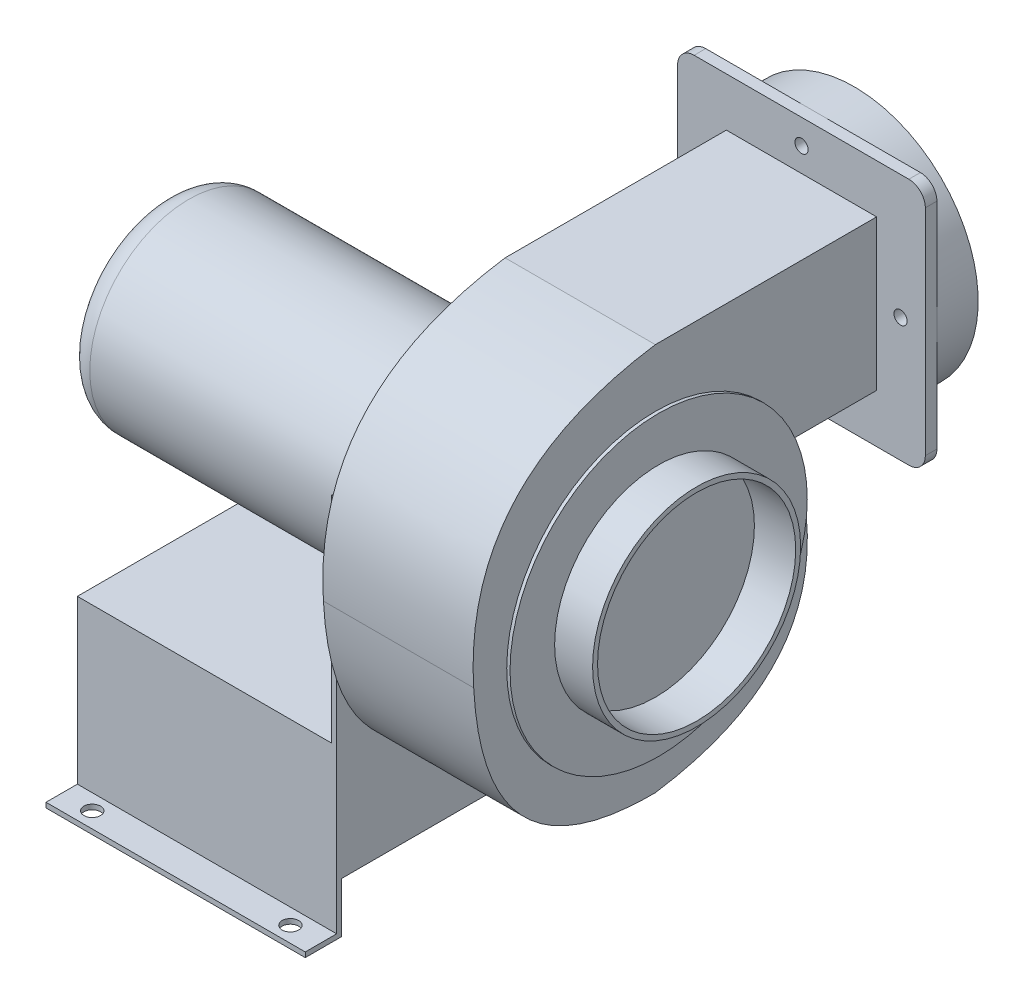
ISO-10303-21;
HEADER;
FILE_DESCRIPTION(('STEP AP214'),'2;1');
FILE_NAME('part.step','',(''),(''),'','','');
FILE_SCHEMA(('AUTOMOTIVE_DESIGN { 1 0 10303 214 1 1 1 1 }'));
ENDSEC;
DATA;
#1=APPLICATION_CONTEXT('core data for automotive mechanical design processes');
#2=APPLICATION_PROTOCOL_DEFINITION('international standard','automotive_design',2000,#1);
#3=PRODUCT_CONTEXT('',#1,'mechanical');
#4=PRODUCT('Part','Part','',(#3));
#5=PRODUCT_RELATED_PRODUCT_CATEGORY('part','',(#4));
#6=PRODUCT_DEFINITION_FORMATION('','',#4);
#7=PRODUCT_DEFINITION_CONTEXT('part definition',#1,'design');
#8=PRODUCT_DEFINITION('design','',#6,#7);
#9=PRODUCT_DEFINITION_SHAPE('','',#8);
#10=(LENGTH_UNIT() NAMED_UNIT(*) SI_UNIT(.MILLI.,.METRE.));
#11=(NAMED_UNIT(*) PLANE_ANGLE_UNIT() SI_UNIT($,.RADIAN.));
#12=(NAMED_UNIT(*) SI_UNIT($,.STERADIAN.) SOLID_ANGLE_UNIT());
#13=UNCERTAINTY_MEASURE_WITH_UNIT(LENGTH_MEASURE(1.E-05),#10,'distance_accuracy_value','');
#14=(GEOMETRIC_REPRESENTATION_CONTEXT(3) GLOBAL_UNCERTAINTY_ASSIGNED_CONTEXT((#13)) GLOBAL_UNIT_ASSIGNED_CONTEXT((#10,
#11,#12)) REPRESENTATION_CONTEXT('',''));
#15=CARTESIAN_POINT('',(0.,0.,0.));
#16=DIRECTION('',(0.,0.,1.));
#17=DIRECTION('',(1.,0.,0.));
#18=AXIS2_PLACEMENT_3D('',#15,#16,#17);
#19=CARTESIAN_POINT('',(-3.,-151.,-102.));
#20=DIRECTION('',(0.,1.,0.));
#21=DIRECTION('',(0.,0.,1.));
#22=AXIS2_PLACEMENT_3D('',#19,#20,#21);
#23=PLANE('',#22);
#24=DIRECTION('',(-1.,0.,0.));
#25=VECTOR('',#24,1.);
#26=CARTESIAN_POINT('',(0.,-151.,-99.));
#27=LINE('',#26,#25);
#28=CARTESIAN_POINT('',(0.,-151.,-99.));
#29=VERTEX_POINT('',#28);
#30=CARTESIAN_POINT('',(-3.,-151.,-99.));
#31=VERTEX_POINT('',#30);
#32=EDGE_CURVE('E53',#29,#31,#27,.T.);
#33=ORIENTED_EDGE('',*,*,#32,.F.);
#34=DIRECTION('',(0.,0.,1.));
#35=VECTOR('',#34,1.);
#36=CARTESIAN_POINT('',(0.,-151.,-102.));
#37=LINE('',#36,#35);
#38=CARTESIAN_POINT('',(0.,-151.,99.));
#39=VERTEX_POINT('',#38);
#40=EDGE_CURVE('E39',#29,#39,#37,.T.);
#41=ORIENTED_EDGE('',*,*,#40,.T.);
#42=DIRECTION('',(1.,0.,0.));
#43=VECTOR('',#42,1.);
#44=CARTESIAN_POINT('',(-157.,-151.,99.));
#45=LINE('',#44,#43);
#46=CARTESIAN_POINT('',(-3.,-151.,99.));
#47=VERTEX_POINT('',#46);
#48=EDGE_CURVE('E11',#47,#39,#45,.T.);
#49=ORIENTED_EDGE('',*,*,#48,.F.);
#50=DIRECTION('',(0.,0.,1.));
#51=VECTOR('',#50,1.);
#52=CARTESIAN_POINT('',(-3.,-151.,-102.));
#53=LINE('',#52,#51);
#54=EDGE_CURVE('E379',#31,#47,#53,.T.);
#55=ORIENTED_EDGE('',*,*,#54,.F.);
#56=EDGE_LOOP('',(#33,#41,#49,#55));
#57=FACE_BOUND('',#56,.T.);
#58=ADVANCED_FACE('F35',(#57),#23,.F.);
#59=CARTESIAN_POINT('',(-3.,0.,0.));
#60=DIRECTION('',(-1.,0.,0.));
#61=DIRECTION('',(0.,0.,1.));
#62=AXIS2_PLACEMENT_3D('',#59,#60,#61);
#63=PLANE('',#62);
#64=DIRECTION('',(0.,0.,1.));
#65=VECTOR('',#64,1.);
#66=CARTESIAN_POINT('',(-3.,-83.,-102.));
#67=LINE('',#66,#65);
#68=CARTESIAN_POINT('',(-3.,-83.,-99.));
#69=VERTEX_POINT('',#68);
#70=CARTESIAN_POINT('',(-3.,-83.,99.));
#71=VERTEX_POINT('',#70);
#72=EDGE_CURVE('E406',#69,#71,#67,.T.);
#73=ORIENTED_EDGE('',*,*,#72,.F.);
#74=DIRECTION('',(0.,1.,0.));
#75=VECTOR('',#74,1.);
#76=CARTESIAN_POINT('',(-3.,-151.,-99.));
#77=LINE('',#76,#75);
#78=EDGE_CURVE('E302',#31,#69,#77,.T.);
#79=ORIENTED_EDGE('',*,*,#78,.F.);
#80=ORIENTED_EDGE('',*,*,#54,.T.);
#81=DIRECTION('',(0.,1.,0.));
#82=VECTOR('',#81,1.);
#83=CARTESIAN_POINT('',(-3.,-151.,99.));
#84=LINE('',#83,#82);
#85=EDGE_CURVE('E386',#47,#71,#84,.T.);
#86=ORIENTED_EDGE('',*,*,#85,.T.);
#87=EDGE_LOOP('',(#73,#79,#80,#86));
#88=FACE_BOUND('',#87,.T.);
#89=ADVANCED_FACE('F741',(#88),#63,.T.);
#90=CARTESIAN_POINT('',(-157.,-83.,-102.));
#91=DIRECTION('',(0.,1.,0.));
#92=DIRECTION('',(0.,0.,1.));
#93=AXIS2_PLACEMENT_3D('',#90,#91,#92);
#94=PLANE('',#93);
#95=DIRECTION('',(-1.,0.,0.));
#96=VECTOR('',#95,1.);
#97=CARTESIAN_POINT('',(-3.,-83.,-99.));
#98=LINE('',#97,#96);
#99=CARTESIAN_POINT('',(-157.,-83.,-99.));
#100=VERTEX_POINT('',#99);
#101=EDGE_CURVE('E300',#69,#100,#98,.T.);
#102=ORIENTED_EDGE('',*,*,#101,.F.);
#103=ORIENTED_EDGE('',*,*,#72,.T.);
#104=DIRECTION('',(1.,0.,0.));
#105=VECTOR('',#104,1.);
#106=CARTESIAN_POINT('',(-157.,-83.,99.));
#107=LINE('',#106,#105);
#108=CARTESIAN_POINT('',(-157.,-83.,99.));
#109=VERTEX_POINT('',#108);
#110=EDGE_CURVE('E389',#109,#71,#107,.T.);
#111=ORIENTED_EDGE('',*,*,#110,.F.);
#112=DIRECTION('',(0.,0.,1.));
#113=VECTOR('',#112,1.);
#114=CARTESIAN_POINT('',(-157.,-83.,-102.));
#115=LINE('',#114,#113);
#116=EDGE_CURVE('E410',#100,#109,#115,.T.);
#117=ORIENTED_EDGE('',*,*,#116,.F.);
#118=EDGE_LOOP('',(#102,#103,#111,#117));
#119=FACE_BOUND('',#118,.T.);
#120=ADVANCED_FACE('F746',(#119),#94,.F.);
#121=DIRECTION('',(0.,-1.,0.));
#122=VECTOR('',#121,1.);
#123=CARTESIAN_POINT('',(-3.,50.,-102.));
#124=LINE('',#123,#122);
#125=CARTESIAN_POINT('',(-3.,50.,-102.));
#126=VERTEX_POINT('',#125);
#127=CARTESIAN_POINT('',(-3.,-80.,-102.));
#128=VERTEX_POINT('',#127);
#129=EDGE_CURVE('E383',#126,#128,#124,.T.);
#130=ORIENTED_EDGE('',*,*,#129,.T.);
#131=DIRECTION('',(0.,0.,-1.));
#132=VECTOR('',#131,1.);
#133=CARTESIAN_POINT('',(-3.,-80.,102.));
#134=LINE('',#133,#132);
#135=CARTESIAN_POINT('',(-3.,-80.,102.));
#136=VERTEX_POINT('',#135);
#137=EDGE_CURVE('E395',#136,#128,#134,.T.);
#138=ORIENTED_EDGE('',*,*,#137,.F.);
#139=DIRECTION('',(0.,1.,0.));
#140=VECTOR('',#139,1.);
#141=CARTESIAN_POINT('',(-3.,-151.,102.));
#142=LINE('',#141,#140);
#143=CARTESIAN_POINT('',(-3.,50.,102.));
#144=VERTEX_POINT('',#143);
#145=EDGE_CURVE('E382',#136,#144,#142,.T.);
#146=ORIENTED_EDGE('',*,*,#145,.T.);
#147=DIRECTION('',(0.,0.,-1.));
#148=VECTOR('',#147,1.);
#149=CARTESIAN_POINT('',(-3.,50.,33.166247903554));
#150=LINE('',#149,#148);
#151=CARTESIAN_POINT('',(-3.,50.,33.166247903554));
#152=VERTEX_POINT('',#151);
#153=EDGE_CURVE('E429',#144,#152,#150,.T.);
#154=ORIENTED_EDGE('',*,*,#153,.T.);
#155=CARTESIAN_POINT('',(-3.,0.,0.));
#156=DIRECTION('',(1.,0.,0.));
#157=DIRECTION('',(0.,0.,1.));
#158=AXIS2_PLACEMENT_3D('',#155,#156,#157);
#159=CIRCLE('',#158,60.);
#160=CARTESIAN_POINT('',(-3.,50.,-33.166247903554));
#161=VERTEX_POINT('',#160);
#162=EDGE_CURVE('E420',#152,#161,#159,.T.);
#163=ORIENTED_EDGE('',*,*,#162,.T.);
#164=DIRECTION('',(0.,0.,-1.));
#165=VECTOR('',#164,1.);
#166=CARTESIAN_POINT('',(-3.,50.,-102.));
#167=LINE('',#166,#165);
#168=EDGE_CURVE('E423',#161,#126,#167,.T.);
#169=ORIENTED_EDGE('',*,*,#168,.T.);
#170=EDGE_LOOP('',(#130,#138,#146,#154,#163,#169));
#171=FACE_BOUND('',#170,.T.);
#172=ADVANCED_FACE('F748',(#171),#63,.T.);
#173=CARTESIAN_POINT('',(0.,84.987625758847,85.8231497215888));
#174=DIRECTION('',(-1.,0.,0.));
#175=DIRECTION('',(0.,0.,1.));
#176=AXIS2_PLACEMENT_3D('',#173,#174,#175);
#177=PLANE('',#176);
#178=DIRECTION('',(0.,-1.,0.));
#179=VECTOR('',#178,1.);
#180=CARTESIAN_POINT('',(0.,50.,-102.));
#181=LINE('',#180,#179);
#182=CARTESIAN_POINT('',(0.,50.,-102.));
#183=VERTEX_POINT('',#182);
#184=CARTESIAN_POINT('',(0.,34.,-102.));
#185=VERTEX_POINT('',#184);
#186=EDGE_CURVE('E435',#183,#185,#181,.T.);
#187=ORIENTED_EDGE('',*,*,#186,.F.);
#188=DIRECTION('',(0.,0.,-1.));
#189=VECTOR('',#188,1.);
#190=CARTESIAN_POINT('',(0.,50.,-102.));
#191=LINE('',#190,#189);
#192=CARTESIAN_POINT('',(0.,50.,-33.166247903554));
#193=VERTEX_POINT('',#192);
#194=EDGE_CURVE('E419',#193,#183,#191,.T.);
#195=ORIENTED_EDGE('',*,*,#194,.F.);
#196=CARTESIAN_POINT('',(0.,0.,0.));
#197=DIRECTION('',(-1.,0.,0.));
#198=DIRECTION('',(0.,0.,1.));
#199=AXIS2_PLACEMENT_3D('',#196,#197,#198);
#200=CIRCLE('',#199,60.);
#201=CARTESIAN_POINT('',(0.,50.,33.166247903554));
#202=VERTEX_POINT('',#201);
#203=EDGE_CURVE('E458',#202,#193,#200,.T.);
#204=ORIENTED_EDGE('',*,*,#203,.F.);
#205=DIRECTION('',(0.,0.,-1.));
#206=VECTOR('',#205,1.);
#207=CARTESIAN_POINT('',(0.,50.,33.166247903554));
#208=LINE('',#207,#206);
#209=CARTESIAN_POINT('',(0.,50.,102.));
#210=VERTEX_POINT('',#209);
#211=EDGE_CURVE('E424',#210,#202,#208,.T.);
#212=ORIENTED_EDGE('',*,*,#211,.F.);
#213=DIRECTION('',(0.,1.,0.));
#214=VECTOR('',#213,1.);
#215=CARTESIAN_POINT('',(0.,-151.,102.));
#216=LINE('',#215,#214);
#217=CARTESIAN_POINT('',(0.,-45.2049993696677,102.));
#218=VERTEX_POINT('',#217);
#219=EDGE_CURVE('E442',#218,#210,#216,.T.);
#220=ORIENTED_EDGE('',*,*,#219,.F.);
#221=CARTESIAN_POINT('',(0.,0.,110.));
#222=CARTESIAN_POINT('',(0.,-110.876866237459,103.950024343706));
#223=CARTESIAN_POINT('',(0.,-110.,0.));
#224=B_SPLINE_CURVE_WITH_KNOTS('',2,(#221,#222,#223),.UNSPECIFIED.,.F.,.F.,(3,3),(0.,1.),.UNSPECIFIED.);
#225=CARTESIAN_POINT('',(0.,0.,110.));
#226=VERTEX_POINT('',#225);
#227=EDGE_CURVE('E665',#226,#218,#224,.T.);
#228=ORIENTED_EDGE('',*,*,#227,.F.);
#229=CARTESIAN_POINT('',(0.,125.,0.));
#230=CARTESIAN_POINT('',(0.,107.475251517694,116.646299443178));
#231=CARTESIAN_POINT('',(0.,0.,110.));
#232=B_SPLINE_CURVE_WITH_KNOTS('',2,(#229,#230,#231),.UNSPECIFIED.,.F.,.F.,(3,3),(0.,1.),.UNSPECIFIED.);
#233=CARTESIAN_POINT('',(0.,125.,0.));
#234=VERTEX_POINT('',#233);
#235=EDGE_CURVE('E614',#234,#226,#232,.T.);
#236=ORIENTED_EDGE('',*,*,#235,.F.);
#237=DIRECTION('',(0.,0.,1.));
#238=VECTOR('',#237,1.);
#239=CARTESIAN_POINT('',(0.,125.,0.));
#240=LINE('',#239,#238);
#241=CARTESIAN_POINT('',(0.,125.,-134.));
#242=VERTEX_POINT('',#241);
#243=EDGE_CURVE('E622',#242,#234,#240,.T.);
#244=ORIENTED_EDGE('',*,*,#243,.F.);
#245=DIRECTION('',(0.,1.,0.));
#246=VECTOR('',#245,1.);
#247=CARTESIAN_POINT('',(0.,125.,-134.));
#248=LINE('',#247,#246);
#249=CARTESIAN_POINT('',(0.,34.,-134.));
#250=VERTEX_POINT('',#249);
#251=EDGE_CURVE('E691',#250,#242,#248,.T.);
#252=ORIENTED_EDGE('',*,*,#251,.F.);
#253=DIRECTION('',(0.,0.,-1.));
#254=VECTOR('',#253,1.);
#255=CARTESIAN_POINT('',(0.,34.,-134.));
#256=LINE('',#255,#254);
#257=EDGE_CURVE('E687',#185,#250,#256,.T.);
#258=ORIENTED_EDGE('',*,*,#257,.F.);
#259=EDGE_LOOP('',(#187,#195,#204,#212,#220,#228,#236,#244,#252,#258));
#260=FACE_BOUND('',#259,.T.);
#261=ADVANCED_FACE('F763',(#260),#177,.T.);
#262=CARTESIAN_POINT('',(-206.5,0.,0.));
#263=DIRECTION('',(1.,0.,0.));
#264=DIRECTION('',(0.,0.,-1.));
#265=AXIS2_PLACEMENT_3D('',#262,#263,#264);
#266=CYLINDRICAL_SURFACE('',#265,60.);
#267=CARTESIAN_POINT('',(-191.5,0.,0.));
#268=DIRECTION('',(-1.,0.,0.));
#269=DIRECTION('',(0.,0.,1.));
#270=AXIS2_PLACEMENT_3D('',#267,#268,#269);
#271=CIRCLE('',#270,60.);
#272=CARTESIAN_POINT('',(-191.5,0.,60.));
#273=VERTEX_POINT('',#272);
#274=EDGE_CURVE('E45',#273,#273,#271,.F.);
#275=ORIENTED_EDGE('',*,*,#274,.T.);
#276=EDGE_LOOP('',(#275));
#277=FACE_BOUND('',#276,.T.);
#278=DIRECTION('',(1.,0.,0.));
#279=VECTOR('',#278,1.);
#280=CARTESIAN_POINT('',(-3.,50.,-33.166247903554));
#281=LINE('',#280,#279);
#282=EDGE_CURVE('E452',#161,#193,#281,.T.);
#283=ORIENTED_EDGE('',*,*,#282,.F.);
#284=ORIENTED_EDGE('',*,*,#162,.F.);
#285=DIRECTION('',(1.,0.,0.));
#286=VECTOR('',#285,1.);
#287=CARTESIAN_POINT('',(-3.,50.,33.166247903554));
#288=LINE('',#287,#286);
#289=EDGE_CURVE('E432',#152,#202,#288,.T.);
#290=ORIENTED_EDGE('',*,*,#289,.T.);
#291=ORIENTED_EDGE('',*,*,#203,.T.);
#292=EDGE_LOOP('',(#283,#284,#290,#291));
#293=FACE_BOUND('',#292,.T.);
#294=ADVANCED_FACE('F724',(#277,#293),#266,.T.);
#295=CARTESIAN_POINT('',(93.,0.,0.));
#296=DIRECTION('',(1.,0.,0.));
#297=DIRECTION('',(0.,0.,-1.));
#298=AXIS2_PLACEMENT_3D('',#295,#296,#297);
#299=PLANE('',#298);
#300=CARTESIAN_POINT('',(93.,0.,0.));
#301=DIRECTION('',(1.,0.,0.));
#302=DIRECTION('',(0.,0.,-1.));
#303=AXIS2_PLACEMENT_3D('',#300,#301,#302);
#304=CIRCLE('',#303,90.);
#305=CARTESIAN_POINT('',(93.,0.,-90.));
#306=VERTEX_POINT('',#305);
#307=EDGE_CURVE('E476',#306,#306,#304,.T.);
#308=ORIENTED_EDGE('',*,*,#307,.T.);
#309=EDGE_LOOP('',(#308));
#310=FACE_BOUND('',#309,.T.);
#311=CARTESIAN_POINT('',(93.,0.,0.));
#312=DIRECTION('',(1.,0.,0.));
#313=DIRECTION('',(0.,0.,-1.));
#314=AXIS2_PLACEMENT_3D('',#311,#312,#313);
#315=CIRCLE('',#314,63.);
#316=CARTESIAN_POINT('',(93.,0.,-63.));
#317=VERTEX_POINT('',#316);
#318=EDGE_CURVE('E467',#317,#317,#315,.T.);
#319=ORIENTED_EDGE('',*,*,#318,.F.);
#320=EDGE_LOOP('',(#319));
#321=FACE_BOUND('',#320,.T.);
#322=ADVANCED_FACE('F762',(#310,#321),#299,.T.);
#323=CARTESIAN_POINT('',(91.,84.987625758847,85.8231497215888));
#324=DIRECTION('',(-1.,0.,0.));
#325=DIRECTION('',(0.,0.,1.));
#326=AXIS2_PLACEMENT_3D('',#323,#324,#325);
#327=PLANE('',#326);
#328=CARTESIAN_POINT('',(91.,0.,0.));
#329=DIRECTION('',(-1.,0.,0.));
#330=DIRECTION('',(0.,0.,1.));
#331=AXIS2_PLACEMENT_3D('',#328,#329,#330);
#332=CIRCLE('',#331,90.);
#333=CARTESIAN_POINT('',(91.,34.,-83.3306666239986));
#334=VERTEX_POINT('',#333);
#335=CARTESIAN_POINT('',(91.,0.,-90.));
#336=VERTEX_POINT('',#335);
#337=EDGE_CURVE('E715',#334,#336,#332,.F.);
#338=ORIENTED_EDGE('',*,*,#337,.F.);
#339=DIRECTION('',(0.,0.,-1.));
#340=VECTOR('',#339,1.);
#341=CARTESIAN_POINT('',(91.,34.,-134.));
#342=LINE('',#341,#340);
#343=CARTESIAN_POINT('',(91.,34.,-134.));
#344=VERTEX_POINT('',#343);
#345=EDGE_CURVE('E651',#334,#344,#342,.T.);
#346=ORIENTED_EDGE('',*,*,#345,.T.);
#347=DIRECTION('',(0.,1.,0.));
#348=VECTOR('',#347,1.);
#349=CARTESIAN_POINT('',(91.,125.,-134.));
#350=LINE('',#349,#348);
#351=CARTESIAN_POINT('',(91.,125.,-134.));
#352=VERTEX_POINT('',#351);
#353=EDGE_CURVE('E656',#344,#352,#350,.T.);
#354=ORIENTED_EDGE('',*,*,#353,.T.);
#355=DIRECTION('',(0.,0.,1.));
#356=VECTOR('',#355,1.);
#357=CARTESIAN_POINT('',(91.,125.,0.));
#358=LINE('',#357,#356);
#359=CARTESIAN_POINT('',(91.,125.,0.));
#360=VERTEX_POINT('',#359);
#361=EDGE_CURVE('E658',#352,#360,#358,.T.);
#362=ORIENTED_EDGE('',*,*,#361,.T.);
#363=CARTESIAN_POINT('',(91.,125.,0.));
#364=CARTESIAN_POINT('',(91.,107.475251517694,116.646299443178));
#365=CARTESIAN_POINT('',(91.,0.,110.));
#366=B_SPLINE_CURVE_WITH_KNOTS('',2,(#363,#364,#365),.UNSPECIFIED.,.F.,.F.,(3,3),(0.,1.),.UNSPECIFIED.);
#367=CARTESIAN_POINT('',(91.,0.,110.));
#368=VERTEX_POINT('',#367);
#369=EDGE_CURVE('E615',#360,#368,#366,.T.);
#370=ORIENTED_EDGE('',*,*,#369,.T.);
#371=CARTESIAN_POINT('',(91.,0.,110.));
#372=CARTESIAN_POINT('',(91.,-110.876866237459,103.950024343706));
#373=CARTESIAN_POINT('',(91.,-110.,0.));
#374=B_SPLINE_CURVE_WITH_KNOTS('',2,(#371,#372,#373),.UNSPECIFIED.,.F.,.F.,(3,3),(0.,1.),.UNSPECIFIED.);
#375=CARTESIAN_POINT('',(91.,-110.,0.));
#376=VERTEX_POINT('',#375);
#377=EDGE_CURVE('E621',#368,#376,#374,.T.);
#378=ORIENTED_EDGE('',*,*,#377,.T.);
#379=CARTESIAN_POINT('',(91.,-110.,0.));
#380=CARTESIAN_POINT('',(91.,-94.3112767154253,-105.83560582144));
#381=CARTESIAN_POINT('',(91.,0.,-90.));
#382=B_SPLINE_CURVE_WITH_KNOTS('',2,(#379,#380,#381),.UNSPECIFIED.,.F.,.F.,(3,3),(0.,1.),.UNSPECIFIED.);
#383=EDGE_CURVE('E645',#376,#336,#382,.T.);
#384=ORIENTED_EDGE('',*,*,#383,.T.);
#385=EDGE_LOOP('',(#338,#346,#354,#362,#370,#378,#384));
#386=FACE_BOUND('',#385,.T.);
#387=ADVANCED_FACE('F779',(#386),#327,.F.);
#388=CARTESIAN_POINT('',(110.5,144.5,-141.));
#389=DIRECTION('',(0.,0.,1.));
#390=DIRECTION('',(1.,0.,0.));
#391=AXIS2_PLACEMENT_3D('',#388,#389,#390);
#392=PLANE('',#391);
#393=CARTESIAN_POINT('',(45.5,79.5,-141.));
#394=DIRECTION('',(0.,0.,-1.));
#395=DIRECTION('',(-1.,0.,0.));
#396=AXIS2_PLACEMENT_3D('',#393,#394,#395);
#397=CIRCLE('',#396,75.);
#398=CARTESIAN_POINT('',(-29.5,79.5,-141.));
#399=VERTEX_POINT('',#398);
#400=CARTESIAN_POINT('',(45.5,154.5,-141.));
#401=VERTEX_POINT('',#400);
#402=EDGE_CURVE('E483',#399,#401,#397,.T.);
#403=ORIENTED_EDGE('',*,*,#402,.F.);
#404=DIRECTION('',(0.,1.,0.));
#405=VECTOR('',#404,1.);
#406=CARTESIAN_POINT('',(-29.5,14.5000000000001,-141.));
#407=LINE('',#406,#405);
#408=CARTESIAN_POINT('',(-29.5,144.5,-141.));
#409=VERTEX_POINT('',#408);
#410=EDGE_CURVE('E566',#399,#409,#407,.T.);
#411=ORIENTED_EDGE('',*,*,#410,.T.);
#412=CARTESIAN_POINT('',(-19.5,144.5,-141.));
#413=DIRECTION('',(0.,0.,-1.));
#414=DIRECTION('',(1.,0.,0.));
#415=AXIS2_PLACEMENT_3D('',#412,#413,#414);
#416=CIRCLE('',#415,10.);
#417=CARTESIAN_POINT('',(-19.4999999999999,154.5,-141.));
#418=VERTEX_POINT('',#417);
#419=EDGE_CURVE('E569',#409,#418,#416,.T.);
#420=ORIENTED_EDGE('',*,*,#419,.T.);
#421=DIRECTION('',(1.,0.,0.));
#422=VECTOR('',#421,1.);
#423=CARTESIAN_POINT('',(110.5,154.5,-141.));
#424=LINE('',#423,#422);
#425=EDGE_CURVE('E572',#418,#401,#424,.T.);
#426=ORIENTED_EDGE('',*,*,#425,.T.);
#427=EDGE_LOOP('',(#403,#411,#420,#426));
#428=FACE_BOUND('',#427,.T.);
#429=ADVANCED_FACE('F833',(#428),#392,.F.);
#430=CARTESIAN_POINT('',(120.5,79.5,-141.));
#431=VERTEX_POINT('',#430);
#432=EDGE_CURVE('E492',#401,#431,#397,.T.);
#433=ORIENTED_EDGE('',*,*,#432,.F.);
#434=CARTESIAN_POINT('',(110.5,154.5,-141.));
#435=VERTEX_POINT('',#434);
#436=EDGE_CURVE('E571',#401,#435,#424,.T.);
#437=ORIENTED_EDGE('',*,*,#436,.T.);
#438=CARTESIAN_POINT('',(110.5,144.5,-141.));
#439=DIRECTION('',(0.,0.,-1.));
#440=DIRECTION('',(1.,0.,0.));
#441=AXIS2_PLACEMENT_3D('',#438,#439,#440);
#442=CIRCLE('',#441,10.);
#443=CARTESIAN_POINT('',(120.5,144.5,-141.));
#444=VERTEX_POINT('',#443);
#445=EDGE_CURVE('E550',#435,#444,#442,.T.);
#446=ORIENTED_EDGE('',*,*,#445,.T.);
#447=DIRECTION('',(0.,-1.,0.));
#448=VECTOR('',#447,1.);
#449=CARTESIAN_POINT('',(120.5,14.5000000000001,-141.));
#450=LINE('',#449,#448);
#451=EDGE_CURVE('E555',#444,#431,#450,.T.);
#452=ORIENTED_EDGE('',*,*,#451,.T.);
#453=EDGE_LOOP('',(#433,#437,#446,#452));
#454=FACE_BOUND('',#453,.T.);
#455=ADVANCED_FACE('F1184',(#454),#392,.F.);
#456=CARTESIAN_POINT('',(45.5,4.49999999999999,-141.));
#457=VERTEX_POINT('',#456);
#458=EDGE_CURVE('E1321',#431,#457,#397,.T.);
#459=ORIENTED_EDGE('',*,*,#458,.F.);
#460=CARTESIAN_POINT('',(120.5,14.5000000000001,-141.));
#461=VERTEX_POINT('',#460);
#462=EDGE_CURVE('E553',#431,#461,#450,.T.);
#463=ORIENTED_EDGE('',*,*,#462,.T.);
#464=CARTESIAN_POINT('',(110.5,14.5,-141.));
#465=DIRECTION('',(0.,0.,-1.));
#466=DIRECTION('',(1.,0.,0.));
#467=AXIS2_PLACEMENT_3D('',#464,#465,#466);
#468=CIRCLE('',#467,10.);
#469=CARTESIAN_POINT('',(110.5,4.49999999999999,-141.));
#470=VERTEX_POINT('',#469);
#471=EDGE_CURVE('E558',#461,#470,#468,.T.);
#472=ORIENTED_EDGE('',*,*,#471,.T.);
#473=DIRECTION('',(-1.,0.,0.));
#474=VECTOR('',#473,1.);
#475=CARTESIAN_POINT('',(110.5,4.49999999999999,-141.));
#476=LINE('',#475,#474);
#477=EDGE_CURVE('E561',#470,#457,#476,.T.);
#478=ORIENTED_EDGE('',*,*,#477,.T.);
#479=EDGE_LOOP('',(#459,#463,#472,#478));
#480=FACE_BOUND('',#479,.T.);
#481=ADVANCED_FACE('F1174',(#480),#392,.F.);
#482=EDGE_CURVE('E493',#457,#399,#397,.T.);
#483=ORIENTED_EDGE('',*,*,#482,.F.);
#484=CARTESIAN_POINT('',(-19.4999999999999,4.49999999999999,-141.));
#485=VERTEX_POINT('',#484);
#486=EDGE_CURVE('E560',#457,#485,#476,.T.);
#487=ORIENTED_EDGE('',*,*,#486,.T.);
#488=CARTESIAN_POINT('',(-19.5,14.5,-141.));
#489=DIRECTION('',(0.,0.,-1.));
#490=DIRECTION('',(-1.,0.,0.));
#491=AXIS2_PLACEMENT_3D('',#488,#489,#490);
#492=CIRCLE('',#491,10.);
#493=CARTESIAN_POINT('',(-29.5,14.5000000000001,-141.));
#494=VERTEX_POINT('',#493);
#495=EDGE_CURVE('E564',#485,#494,#492,.T.);
#496=ORIENTED_EDGE('',*,*,#495,.T.);
#497=EDGE_CURVE('E567',#494,#399,#407,.T.);
#498=ORIENTED_EDGE('',*,*,#497,.T.);
#499=EDGE_LOOP('',(#483,#487,#496,#498));
#500=FACE_BOUND('',#499,.T.);
#501=ADVANCED_FACE('F634',(#500),#392,.F.);
#502=DIRECTION('',(-1.,0.,0.));
#503=VECTOR('',#502,1.);
#504=SURFACE_OF_LINEAR_EXTRUSION('',#366,#503);
#505=ORIENTED_EDGE('',*,*,#235,.T.);
#506=DIRECTION('',(-1.,0.,0.));
#507=VECTOR('',#506,1.);
#508=CARTESIAN_POINT('',(91.,0.,110.));
#509=LINE('',#508,#507);
#510=EDGE_CURVE('E712',#368,#226,#509,.T.);
#511=ORIENTED_EDGE('',*,*,#510,.F.);
#512=ORIENTED_EDGE('',*,*,#369,.F.);
#513=DIRECTION('',(-1.,0.,0.));
#514=VECTOR('',#513,1.);
#515=CARTESIAN_POINT('',(91.,125.,0.));
#516=LINE('',#515,#514);
#517=EDGE_CURVE('E660',#360,#234,#516,.T.);
#518=ORIENTED_EDGE('',*,*,#517,.T.);
#519=EDGE_LOOP('',(#505,#511,#512,#518));
#520=FACE_BOUND('',#519,.T.);
#521=ADVANCED_FACE('F630',(#520),#504,.F.);
#522=DIRECTION('',(-1.,0.,0.));
#523=VECTOR('',#522,1.);
#524=SURFACE_OF_LINEAR_EXTRUSION('',#374,#523);
#525=ORIENTED_EDGE('',*,*,#227,.T.);
#526=CARTESIAN_POINT('',(0.,0.,110.));
#527=CARTESIAN_POINT('',(0.,-110.876866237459,103.950024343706));
#528=CARTESIAN_POINT('',(0.,-110.,0.));
#529=B_SPLINE_CURVE_WITH_KNOTS('',2,(#526,#527,#528),.UNSPECIFIED.,.F.,.F.,(3,3),(0.,1.),.UNSPECIFIED.);
#530=CARTESIAN_POINT('',(0.,-110.,0.));
#531=VERTEX_POINT('',#530);
#532=EDGE_CURVE('E454',#531,#218,#529,.F.);
#533=ORIENTED_EDGE('',*,*,#532,.F.);
#534=DIRECTION('',(-1.,0.,0.));
#535=VECTOR('',#534,1.);
#536=CARTESIAN_POINT('',(91.,-110.,0.));
#537=LINE('',#536,#535);
#538=EDGE_CURVE('E709',#376,#531,#537,.T.);
#539=ORIENTED_EDGE('',*,*,#538,.F.);
#540=ORIENTED_EDGE('',*,*,#377,.F.);
#541=ORIENTED_EDGE('',*,*,#510,.T.);
#542=EDGE_LOOP('',(#525,#533,#539,#540,#541));
#543=FACE_BOUND('',#542,.T.);
#544=ADVANCED_FACE('F633',(#543),#524,.F.);
#545=DIRECTION('',(-1.,0.,0.));
#546=VECTOR('',#545,1.);
#547=SURFACE_OF_LINEAR_EXTRUSION('',#382,#546);
#548=CARTESIAN_POINT('',(0.,-110.,0.));
#549=CARTESIAN_POINT('',(0.,-94.3112767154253,-105.83560582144));
#550=CARTESIAN_POINT('',(0.,0.,-90.));
#551=B_SPLINE_CURVE_WITH_KNOTS('',2,(#548,#549,#550),.UNSPECIFIED.,.F.,.F.,(3,3),(0.,1.),.UNSPECIFIED.);
#552=CARTESIAN_POINT('',(0.,0.,-90.));
#553=VERTEX_POINT('',#552);
#554=EDGE_CURVE('E673',#531,#553,#551,.T.);
#555=ORIENTED_EDGE('',*,*,#554,.T.);
#556=DIRECTION('',(-1.,0.,0.));
#557=VECTOR('',#556,1.);
#558=CARTESIAN_POINT('',(91.,0.,-90.));
#559=LINE('',#558,#557);
#560=EDGE_CURVE('E706',#336,#553,#559,.T.);
#561=ORIENTED_EDGE('',*,*,#560,.F.);
#562=ORIENTED_EDGE('',*,*,#383,.F.);
#563=ORIENTED_EDGE('',*,*,#538,.T.);
#564=EDGE_LOOP('',(#555,#561,#562,#563));
#565=FACE_BOUND('',#564,.T.);
#566=ADVANCED_FACE('F638',(#565),#547,.F.);
#567=CARTESIAN_POINT('',(91.,0.,0.));
#568=DIRECTION('',(-1.,0.,0.));
#569=DIRECTION('',(0.,0.,1.));
#570=AXIS2_PLACEMENT_3D('',#567,#568,#569);
#571=CYLINDRICAL_SURFACE('',#570,90.);
#572=CARTESIAN_POINT('',(0.,0.,0.));
#573=DIRECTION('',(1.,0.,0.));
#574=DIRECTION('',(0.,0.,-1.));
#575=AXIS2_PLACEMENT_3D('',#572,#573,#574);
#576=CIRCLE('',#575,90.);
#577=CARTESIAN_POINT('',(0.,34.,-83.3306666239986));
#578=VERTEX_POINT('',#577);
#579=EDGE_CURVE('E681',#553,#578,#576,.T.);
#580=ORIENTED_EDGE('',*,*,#579,.T.);
#581=DIRECTION('',(-1.,0.,0.));
#582=VECTOR('',#581,1.);
#583=CARTESIAN_POINT('',(91.,34.,-83.3306666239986));
#584=LINE('',#583,#582);
#585=EDGE_CURVE('E703',#334,#578,#584,.T.);
#586=ORIENTED_EDGE('',*,*,#585,.F.);
#587=ORIENTED_EDGE('',*,*,#337,.T.);
#588=ORIENTED_EDGE('',*,*,#560,.T.);
#589=EDGE_LOOP('',(#580,#586,#587,#588));
#590=FACE_BOUND('',#589,.T.);
#591=ORIENTED_EDGE('',*,*,#307,.F.);
#592=EDGE_LOOP('',(#591));
#593=FACE_BOUND('',#592,.T.);
#594=ADVANCED_FACE('F642',(#590,#593),#571,.T.);
#595=CARTESIAN_POINT('',(91.,34.,-134.));
#596=DIRECTION('',(0.,1.,0.));
#597=DIRECTION('',(0.,0.,1.));
#598=AXIS2_PLACEMENT_3D('',#595,#596,#597);
#599=PLANE('',#598);
#600=EDGE_CURVE('E688',#578,#185,#256,.T.);
#601=ORIENTED_EDGE('',*,*,#600,.T.);
#602=ORIENTED_EDGE('',*,*,#257,.T.);
#603=DIRECTION('',(-1.,0.,0.));
#604=VECTOR('',#603,1.);
#605=CARTESIAN_POINT('',(91.,34.,-134.));
#606=LINE('',#605,#604);
#607=EDGE_CURVE('E700',#344,#250,#606,.T.);
#608=ORIENTED_EDGE('',*,*,#607,.F.);
#609=ORIENTED_EDGE('',*,*,#345,.F.);
#610=ORIENTED_EDGE('',*,*,#585,.T.);
#611=EDGE_LOOP('',(#601,#602,#608,#609,#610));
#612=FACE_BOUND('',#611,.T.);
#613=ADVANCED_FACE('F877',(#612),#599,.F.);
#614=CARTESIAN_POINT('',(91.,125.,0.));
#615=DIRECTION('',(0.,-1.,0.));
#616=DIRECTION('',(0.,0.,-1.));
#617=AXIS2_PLACEMENT_3D('',#614,#615,#616);
#618=PLANE('',#617);
#619=ORIENTED_EDGE('',*,*,#243,.T.);
#620=ORIENTED_EDGE('',*,*,#517,.F.);
#621=ORIENTED_EDGE('',*,*,#361,.F.);
#622=DIRECTION('',(-1.,0.,0.));
#623=VECTOR('',#622,1.);
#624=CARTESIAN_POINT('',(91.,125.,-134.));
#625=LINE('',#624,#623);
#626=EDGE_CURVE('E697',#352,#242,#625,.T.);
#627=ORIENTED_EDGE('',*,*,#626,.T.);
#628=EDGE_LOOP('',(#619,#620,#621,#627));
#629=FACE_BOUND('',#628,.T.);
#630=ADVANCED_FACE('F838',(#629),#618,.F.);
#631=CARTESIAN_POINT('',(110.5,144.5,-134.));
#632=DIRECTION('',(0.,0.,1.));
#633=DIRECTION('',(1.,0.,0.));
#634=AXIS2_PLACEMENT_3D('',#631,#632,#633);
#635=PLANE('',#634);
#636=CARTESIAN_POINT('',(105.5,79.5,-134.));
#637=DIRECTION('',(0.,0.,-1.));
#638=DIRECTION('',(-1.,0.,0.));
#639=AXIS2_PLACEMENT_3D('',#636,#637,#638);
#640=CIRCLE('',#639,4.00000000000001);
#641=CARTESIAN_POINT('',(101.5,79.5,-134.));
#642=VERTEX_POINT('',#641);
#643=EDGE_CURVE('E526',#642,#642,#640,.T.);
#644=ORIENTED_EDGE('',*,*,#643,.T.);
#645=EDGE_LOOP('',(#644));
#646=FACE_BOUND('',#645,.T.);
#647=CARTESIAN_POINT('',(45.5,19.5,-134.));
#648=DIRECTION('',(0.,0.,-1.));
#649=DIRECTION('',(-1.,0.,0.));
#650=AXIS2_PLACEMENT_3D('',#647,#648,#649);
#651=CIRCLE('',#650,4.00000000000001);
#652=CARTESIAN_POINT('',(41.5,19.5,-134.));
#653=VERTEX_POINT('',#652);
#654=EDGE_CURVE('E532',#653,#653,#651,.T.);
#655=ORIENTED_EDGE('',*,*,#654,.T.);
#656=EDGE_LOOP('',(#655));
#657=FACE_BOUND('',#656,.T.);
#658=CARTESIAN_POINT('',(-14.5,79.5,-134.));
#659=DIRECTION('',(0.,0.,-1.));
#660=DIRECTION('',(-1.,0.,0.));
#661=AXIS2_PLACEMENT_3D('',#658,#659,#660);
#662=CIRCLE('',#661,4.);
#663=CARTESIAN_POINT('',(-18.5,79.5,-134.));
#664=VERTEX_POINT('',#663);
#665=EDGE_CURVE('E538',#664,#664,#662,.T.);
#666=ORIENTED_EDGE('',*,*,#665,.T.);
#667=EDGE_LOOP('',(#666));
#668=FACE_BOUND('',#667,.T.);
#669=CARTESIAN_POINT('',(45.5,139.5,-134.));
#670=DIRECTION('',(0.,0.,-1.));
#671=DIRECTION('',(-1.,0.,0.));
#672=AXIS2_PLACEMENT_3D('',#669,#670,#671);
#673=CIRCLE('',#672,4.00000000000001);
#674=CARTESIAN_POINT('',(41.5,139.5,-134.));
#675=VERTEX_POINT('',#674);
#676=EDGE_CURVE('E544',#675,#675,#673,.T.);
#677=ORIENTED_EDGE('',*,*,#676,.T.);
#678=EDGE_LOOP('',(#677));
#679=FACE_BOUND('',#678,.T.);
#680=CARTESIAN_POINT('',(110.5,144.5,-134.));
#681=DIRECTION('',(0.,0.,-1.));
#682=DIRECTION('',(1.,0.,0.));
#683=AXIS2_PLACEMENT_3D('',#680,#681,#682);
#684=CIRCLE('',#683,10.);
#685=CARTESIAN_POINT('',(110.5,154.5,-134.));
#686=VERTEX_POINT('',#685);
#687=CARTESIAN_POINT('',(120.5,144.5,-134.));
#688=VERTEX_POINT('',#687);
#689=EDGE_CURVE('E547',#686,#688,#684,.T.);
#690=ORIENTED_EDGE('',*,*,#689,.F.);
#691=DIRECTION('',(1.,0.,0.));
#692=VECTOR('',#691,1.);
#693=CARTESIAN_POINT('',(110.5,154.5,-134.));
#694=LINE('',#693,#692);
#695=CARTESIAN_POINT('',(-19.4999999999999,154.5,-134.));
#696=VERTEX_POINT('',#695);
#697=EDGE_CURVE('E554',#696,#686,#694,.T.);
#698=ORIENTED_EDGE('',*,*,#697,.F.);
#699=CARTESIAN_POINT('',(-19.5,144.5,-134.));
#700=DIRECTION('',(0.,0.,-1.));
#701=DIRECTION('',(1.,0.,0.));
#702=AXIS2_PLACEMENT_3D('',#699,#700,#701);
#703=CIRCLE('',#702,10.);
#704=CARTESIAN_POINT('',(-29.5,144.5,-134.));
#705=VERTEX_POINT('',#704);
#706=EDGE_CURVE('E588',#705,#696,#703,.T.);
#707=ORIENTED_EDGE('',*,*,#706,.F.);
#708=DIRECTION('',(0.,1.,0.));
#709=VECTOR('',#708,1.);
#710=CARTESIAN_POINT('',(-29.5,14.5000000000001,-134.));
#711=LINE('',#710,#709);
#712=CARTESIAN_POINT('',(-29.5,14.5000000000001,-134.));
#713=VERTEX_POINT('',#712);
#714=EDGE_CURVE('E586',#713,#705,#711,.T.);
#715=ORIENTED_EDGE('',*,*,#714,.F.);
#716=CARTESIAN_POINT('',(-19.5,14.5,-134.));
#717=DIRECTION('',(0.,0.,-1.));
#718=DIRECTION('',(-1.,0.,0.));
#719=AXIS2_PLACEMENT_3D('',#716,#717,#718);
#720=CIRCLE('',#719,10.);
#721=CARTESIAN_POINT('',(-19.4999999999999,4.49999999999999,-134.));
#722=VERTEX_POINT('',#721);
#723=EDGE_CURVE('E584',#722,#713,#720,.T.);
#724=ORIENTED_EDGE('',*,*,#723,.F.);
#725=DIRECTION('',(-1.,0.,0.));
#726=VECTOR('',#725,1.);
#727=CARTESIAN_POINT('',(110.5,4.49999999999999,-134.));
#728=LINE('',#727,#726);
#729=CARTESIAN_POINT('',(110.5,4.49999999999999,-134.));
#730=VERTEX_POINT('',#729);
#731=EDGE_CURVE('E582',#730,#722,#728,.T.);
#732=ORIENTED_EDGE('',*,*,#731,.F.);
#733=CARTESIAN_POINT('',(110.5,14.5,-134.));
#734=DIRECTION('',(0.,0.,-1.));
#735=DIRECTION('',(1.,0.,0.));
#736=AXIS2_PLACEMENT_3D('',#733,#734,#735);
#737=CIRCLE('',#736,10.);
#738=CARTESIAN_POINT('',(120.5,14.5000000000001,-134.));
#739=VERTEX_POINT('',#738);
#740=EDGE_CURVE('E580',#739,#730,#737,.T.);
#741=ORIENTED_EDGE('',*,*,#740,.F.);
#742=DIRECTION('',(0.,-1.,0.));
#743=VECTOR('',#742,1.);
#744=CARTESIAN_POINT('',(120.5,14.5000000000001,-134.));
#745=LINE('',#744,#743);
#746=EDGE_CURVE('E578',#688,#739,#745,.T.);
#747=ORIENTED_EDGE('',*,*,#746,.F.);
#748=EDGE_LOOP('',(#690,#698,#707,#715,#724,#732,#741,#747));
#749=FACE_BOUND('',#748,.T.);
#750=ORIENTED_EDGE('',*,*,#353,.F.);
#751=ORIENTED_EDGE('',*,*,#607,.T.);
#752=ORIENTED_EDGE('',*,*,#251,.T.);
#753=ORIENTED_EDGE('',*,*,#626,.F.);
#754=EDGE_LOOP('',(#750,#751,#752,#753));
#755=FACE_BOUND('',#754,.T.);
#756=ADVANCED_FACE('F834',(#646,#657,#668,#679,#749,#755),#635,.T.);
#757=CARTESIAN_POINT('',(110.5,144.5,-141.));
#758=DIRECTION('',(0.,0.,1.));
#759=DIRECTION('',(1.,0.,0.));
#760=AXIS2_PLACEMENT_3D('',#757,#758,#759);
#761=CYLINDRICAL_SURFACE('',#760,10.);
#762=ORIENTED_EDGE('',*,*,#689,.T.);
#763=DIRECTION('',(0.,0.,1.));
#764=VECTOR('',#763,1.);
#765=CARTESIAN_POINT('',(120.5,144.5,-141.));
#766=LINE('',#765,#764);
#767=EDGE_CURVE('E611',#444,#688,#766,.T.);
#768=ORIENTED_EDGE('',*,*,#767,.F.);
#769=ORIENTED_EDGE('',*,*,#445,.F.);
#770=DIRECTION('',(0.,0.,1.));
#771=VECTOR('',#770,1.);
#772=CARTESIAN_POINT('',(110.5,154.5,-141.));
#773=LINE('',#772,#771);
#774=EDGE_CURVE('E575',#435,#686,#773,.T.);
#775=ORIENTED_EDGE('',*,*,#774,.T.);
#776=EDGE_LOOP('',(#762,#768,#769,#775));
#777=FACE_BOUND('',#776,.T.);
#778=ADVANCED_FACE('F837',(#777),#761,.T.);
#779=CARTESIAN_POINT('',(120.5,14.5000000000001,-141.));
#780=DIRECTION('',(-1.,0.,0.));
#781=DIRECTION('',(0.,0.,1.));
#782=AXIS2_PLACEMENT_3D('',#779,#780,#781);
#783=PLANE('',#782);
#784=ORIENTED_EDGE('',*,*,#746,.T.);
#785=DIRECTION('',(0.,0.,1.));
#786=VECTOR('',#785,1.);
#787=CARTESIAN_POINT('',(120.5,14.5000000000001,-141.));
#788=LINE('',#787,#786);
#789=EDGE_CURVE('E608',#461,#739,#788,.T.);
#790=ORIENTED_EDGE('',*,*,#789,.F.);
#791=ORIENTED_EDGE('',*,*,#462,.F.);
#792=ORIENTED_EDGE('',*,*,#451,.F.);
#793=ORIENTED_EDGE('',*,*,#767,.T.);
#794=EDGE_LOOP('',(#784,#790,#791,#792,#793));
#795=FACE_BOUND('',#794,.T.);
#796=ADVANCED_FACE('F862',(#795),#783,.F.);
#797=CARTESIAN_POINT('',(110.5,14.5,-141.));
#798=DIRECTION('',(0.,0.,1.));
#799=DIRECTION('',(1.,0.,0.));
#800=AXIS2_PLACEMENT_3D('',#797,#798,#799);
#801=CYLINDRICAL_SURFACE('',#800,10.);
#802=ORIENTED_EDGE('',*,*,#740,.T.);
#803=DIRECTION('',(0.,0.,1.));
#804=VECTOR('',#803,1.);
#805=CARTESIAN_POINT('',(110.5,4.49999999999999,-141.));
#806=LINE('',#805,#804);
#807=EDGE_CURVE('E605',#470,#730,#806,.T.);
#808=ORIENTED_EDGE('',*,*,#807,.F.);
#809=ORIENTED_EDGE('',*,*,#471,.F.);
#810=ORIENTED_EDGE('',*,*,#789,.T.);
#811=EDGE_LOOP('',(#802,#808,#809,#810));
#812=FACE_BOUND('',#811,.T.);
#813=ADVANCED_FACE('F858',(#812),#801,.T.);
#814=CARTESIAN_POINT('',(110.5,4.49999999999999,-141.));
#815=DIRECTION('',(0.,1.,0.));
#816=DIRECTION('',(0.,0.,1.));
#817=AXIS2_PLACEMENT_3D('',#814,#815,#816);
#818=PLANE('',#817);
#819=ORIENTED_EDGE('',*,*,#731,.T.);
#820=DIRECTION('',(0.,0.,1.));
#821=VECTOR('',#820,1.);
#822=CARTESIAN_POINT('',(-19.4999999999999,4.49999999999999,-141.));
#823=LINE('',#822,#821);
#824=EDGE_CURVE('E602',#485,#722,#823,.T.);
#825=ORIENTED_EDGE('',*,*,#824,.F.);
#826=ORIENTED_EDGE('',*,*,#486,.F.);
#827=ORIENTED_EDGE('',*,*,#477,.F.);
#828=ORIENTED_EDGE('',*,*,#807,.T.);
#829=EDGE_LOOP('',(#819,#825,#826,#827,#828));
#830=FACE_BOUND('',#829,.T.);
#831=ADVANCED_FACE('F854',(#830),#818,.F.);
#832=CARTESIAN_POINT('',(-19.5,14.5,-141.));
#833=DIRECTION('',(0.,0.,1.));
#834=DIRECTION('',(1.,0.,0.));
#835=AXIS2_PLACEMENT_3D('',#832,#833,#834);
#836=CYLINDRICAL_SURFACE('',#835,10.);
#837=ORIENTED_EDGE('',*,*,#723,.T.);
#838=DIRECTION('',(0.,0.,1.));
#839=VECTOR('',#838,1.);
#840=CARTESIAN_POINT('',(-29.5,14.5000000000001,-141.));
#841=LINE('',#840,#839);
#842=EDGE_CURVE('E599',#494,#713,#841,.T.);
#843=ORIENTED_EDGE('',*,*,#842,.F.);
#844=ORIENTED_EDGE('',*,*,#495,.F.);
#845=ORIENTED_EDGE('',*,*,#824,.T.);
#846=EDGE_LOOP('',(#837,#843,#844,#845));
#847=FACE_BOUND('',#846,.T.);
#848=ADVANCED_FACE('F850',(#847),#836,.T.);
#849=CARTESIAN_POINT('',(-29.5,14.5000000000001,-141.));
#850=DIRECTION('',(1.,0.,0.));
#851=DIRECTION('',(0.,0.,-1.));
#852=AXIS2_PLACEMENT_3D('',#849,#850,#851);
#853=PLANE('',#852);
#854=ORIENTED_EDGE('',*,*,#714,.T.);
#855=DIRECTION('',(0.,0.,1.));
#856=VECTOR('',#855,1.);
#857=CARTESIAN_POINT('',(-29.5,144.5,-141.));
#858=LINE('',#857,#856);
#859=EDGE_CURVE('E596',#409,#705,#858,.T.);
#860=ORIENTED_EDGE('',*,*,#859,.F.);
#861=ORIENTED_EDGE('',*,*,#410,.F.);
#862=ORIENTED_EDGE('',*,*,#497,.F.);
#863=ORIENTED_EDGE('',*,*,#842,.T.);
#864=EDGE_LOOP('',(#854,#860,#861,#862,#863));
#865=FACE_BOUND('',#864,.T.);
#866=ADVANCED_FACE('F846',(#865),#853,.F.);
#867=CARTESIAN_POINT('',(-19.5,144.5,-141.));
#868=DIRECTION('',(0.,0.,1.));
#869=DIRECTION('',(1.,0.,0.));
#870=AXIS2_PLACEMENT_3D('',#867,#868,#869);
#871=CYLINDRICAL_SURFACE('',#870,10.);
#872=ORIENTED_EDGE('',*,*,#706,.T.);
#873=DIRECTION('',(0.,0.,1.));
#874=VECTOR('',#873,1.);
#875=CARTESIAN_POINT('',(-19.4999999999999,154.5,-141.));
#876=LINE('',#875,#874);
#877=EDGE_CURVE('E593',#418,#696,#876,.T.);
#878=ORIENTED_EDGE('',*,*,#877,.F.);
#879=ORIENTED_EDGE('',*,*,#419,.F.);
#880=ORIENTED_EDGE('',*,*,#859,.T.);
#881=EDGE_LOOP('',(#872,#878,#879,#880));
#882=FACE_BOUND('',#881,.T.);
#883=ADVANCED_FACE('F842',(#882),#871,.T.);
#884=CARTESIAN_POINT('',(110.5,154.5,-141.));
#885=DIRECTION('',(0.,-1.,0.));
#886=DIRECTION('',(0.,0.,-1.));
#887=AXIS2_PLACEMENT_3D('',#884,#885,#886);
#888=PLANE('',#887);
#889=ORIENTED_EDGE('',*,*,#697,.T.);
#890=ORIENTED_EDGE('',*,*,#774,.F.);
#891=ORIENTED_EDGE('',*,*,#436,.F.);
#892=ORIENTED_EDGE('',*,*,#425,.F.);
#893=ORIENTED_EDGE('',*,*,#877,.T.);
#894=EDGE_LOOP('',(#889,#890,#891,#892,#893));
#895=FACE_BOUND('',#894,.T.);
#896=ADVANCED_FACE('F831',(#895),#888,.F.);
#897=CARTESIAN_POINT('',(45.5,79.5,-141.));
#898=DIRECTION('',(0.,0.,-1.));
#899=DIRECTION('',(-1.,0.,0.));
#900=AXIS2_PLACEMENT_3D('',#897,#898,#899);
#901=CIRCLE('',#900,72.);
#902=CARTESIAN_POINT('',(-26.5,79.5,-141.));
#903=VERTEX_POINT('',#902);
#904=EDGE_CURVE('E479',#903,#903,#901,.T.);
#905=ORIENTED_EDGE('',*,*,#904,.T.);
#906=EDGE_LOOP('',(#905));
#907=FACE_BOUND('',#906,.T.);
#908=DIRECTION('',(1.,0.,0.));
#909=VECTOR('',#908,1.);
#910=CARTESIAN_POINT('',(90.5,124.5,-141.));
#911=LINE('',#910,#909);
#912=CARTESIAN_POINT('',(0.5,124.5,-141.));
#913=VERTEX_POINT('',#912);
#914=CARTESIAN_POINT('',(90.5,124.5,-141.));
#915=VERTEX_POINT('',#914);
#916=EDGE_CURVE('E509',#913,#915,#911,.T.);
#917=ORIENTED_EDGE('',*,*,#916,.F.);
#918=DIRECTION('',(0.,1.,0.));
#919=VECTOR('',#918,1.);
#920=CARTESIAN_POINT('',(0.499999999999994,34.5,-141.));
#921=LINE('',#920,#919);
#922=CARTESIAN_POINT('',(0.499999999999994,34.5,-141.));
#923=VERTEX_POINT('',#922);
#924=EDGE_CURVE('E489',#923,#913,#921,.T.);
#925=ORIENTED_EDGE('',*,*,#924,.F.);
#926=DIRECTION('',(-1.,0.,0.));
#927=VECTOR('',#926,1.);
#928=CARTESIAN_POINT('',(90.5,34.5,-141.));
#929=LINE('',#928,#927);
#930=CARTESIAN_POINT('',(90.5,34.5,-141.));
#931=VERTEX_POINT('',#930);
#932=EDGE_CURVE('E498',#931,#923,#929,.T.);
#933=ORIENTED_EDGE('',*,*,#932,.F.);
#934=DIRECTION('',(0.,-1.,0.));
#935=VECTOR('',#934,1.);
#936=CARTESIAN_POINT('',(90.5,34.5,-141.));
#937=LINE('',#936,#935);
#938=EDGE_CURVE('E512',#915,#931,#937,.T.);
#939=ORIENTED_EDGE('',*,*,#938,.F.);
#940=EDGE_LOOP('',(#917,#925,#933,#939));
#941=FACE_BOUND('',#940,.T.);
#942=CARTESIAN_POINT('',(105.5,79.5,-141.));
#943=DIRECTION('',(0.,0.,-1.));
#944=DIRECTION('',(-1.,0.,0.));
#945=AXIS2_PLACEMENT_3D('',#942,#943,#944);
#946=CIRCLE('',#945,4.00000000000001);
#947=CARTESIAN_POINT('',(101.5,79.5,-141.));
#948=VERTEX_POINT('',#947);
#949=EDGE_CURVE('E519',#948,#948,#946,.T.);
#950=ORIENTED_EDGE('',*,*,#949,.F.);
#951=EDGE_LOOP('',(#950));
#952=FACE_BOUND('',#951,.T.);
#953=CARTESIAN_POINT('',(45.5,19.5,-141.));
#954=DIRECTION('',(0.,0.,-1.));
#955=DIRECTION('',(-1.,0.,0.));
#956=AXIS2_PLACEMENT_3D('',#953,#954,#955);
#957=CIRCLE('',#956,4.00000000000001);
#958=CARTESIAN_POINT('',(41.5,19.5,-141.));
#959=VERTEX_POINT('',#958);
#960=EDGE_CURVE('E529',#959,#959,#957,.T.);
#961=ORIENTED_EDGE('',*,*,#960,.F.);
#962=EDGE_LOOP('',(#961));
#963=FACE_BOUND('',#962,.T.);
#964=CARTESIAN_POINT('',(-14.5,79.5,-141.));
#965=DIRECTION('',(0.,0.,-1.));
#966=DIRECTION('',(-1.,0.,0.));
#967=AXIS2_PLACEMENT_3D('',#964,#965,#966);
#968=CIRCLE('',#967,4.);
#969=CARTESIAN_POINT('',(-18.5,79.5,-141.));
#970=VERTEX_POINT('',#969);
#971=EDGE_CURVE('E535',#970,#970,#968,.T.);
#972=ORIENTED_EDGE('',*,*,#971,.F.);
#973=EDGE_LOOP('',(#972));
#974=FACE_BOUND('',#973,.T.);
#975=CARTESIAN_POINT('',(45.5,139.5,-141.));
#976=DIRECTION('',(0.,0.,-1.));
#977=DIRECTION('',(-1.,0.,0.));
#978=AXIS2_PLACEMENT_3D('',#975,#976,#977);
#979=CIRCLE('',#978,4.00000000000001);
#980=CARTESIAN_POINT('',(41.5,139.5,-141.));
#981=VERTEX_POINT('',#980);
#982=EDGE_CURVE('E541',#981,#981,#979,.T.);
#983=ORIENTED_EDGE('',*,*,#982,.F.);
#984=EDGE_LOOP('',(#983));
#985=FACE_BOUND('',#984,.T.);
#986=ADVANCED_FACE('F827',(#907,#941,#952,#963,#974,#985),#392,.F.);
#987=CARTESIAN_POINT('',(45.5,139.5,-134.));
#988=DIRECTION('',(0.,0.,-1.));
#989=DIRECTION('',(-1.,0.,0.));
#990=AXIS2_PLACEMENT_3D('',#987,#988,#989);
#991=CYLINDRICAL_SURFACE('',#990,4.00000000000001);
#992=ORIENTED_EDGE('',*,*,#676,.F.);
#993=EDGE_LOOP('',(#992));
#994=FACE_BOUND('',#993,.T.);
#995=ORIENTED_EDGE('',*,*,#982,.T.);
#996=EDGE_LOOP('',(#995));
#997=FACE_BOUND('',#996,.T.);
#998=ADVANCED_FACE('F823',(#994,#997),#991,.F.);
#999=CARTESIAN_POINT('',(-14.5,79.5,-134.));
#1000=DIRECTION('',(0.,0.,-1.));
#1001=DIRECTION('',(-1.,0.,0.));
#1002=AXIS2_PLACEMENT_3D('',#999,#1000,#1001);
#1003=CYLINDRICAL_SURFACE('',#1002,4.);
#1004=ORIENTED_EDGE('',*,*,#665,.F.);
#1005=EDGE_LOOP('',(#1004));
#1006=FACE_BOUND('',#1005,.T.);
#1007=ORIENTED_EDGE('',*,*,#971,.T.);
#1008=EDGE_LOOP('',(#1007));
#1009=FACE_BOUND('',#1008,.T.);
#1010=ADVANCED_FACE('F819',(#1006,#1009),#1003,.F.);
#1011=CARTESIAN_POINT('',(45.5,19.5,-134.));
#1012=DIRECTION('',(0.,0.,-1.));
#1013=DIRECTION('',(-1.,0.,0.));
#1014=AXIS2_PLACEMENT_3D('',#1011,#1012,#1013);
#1015=CYLINDRICAL_SURFACE('',#1014,4.00000000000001);
#1016=ORIENTED_EDGE('',*,*,#654,.F.);
#1017=EDGE_LOOP('',(#1016));
#1018=FACE_BOUND('',#1017,.T.);
#1019=ORIENTED_EDGE('',*,*,#960,.T.);
#1020=EDGE_LOOP('',(#1019));
#1021=FACE_BOUND('',#1020,.T.);
#1022=ADVANCED_FACE('F815',(#1018,#1021),#1015,.F.);
#1023=CARTESIAN_POINT('',(105.5,79.5,-134.));
#1024=DIRECTION('',(0.,0.,-1.));
#1025=DIRECTION('',(-1.,0.,0.));
#1026=AXIS2_PLACEMENT_3D('',#1023,#1024,#1025);
#1027=CYLINDRICAL_SURFACE('',#1026,4.00000000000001);
#1028=ORIENTED_EDGE('',*,*,#643,.F.);
#1029=EDGE_LOOP('',(#1028));
#1030=FACE_BOUND('',#1029,.T.);
#1031=ORIENTED_EDGE('',*,*,#949,.T.);
#1032=EDGE_LOOP('',(#1031));
#1033=FACE_BOUND('',#1032,.T.);
#1034=ADVANCED_FACE('F811',(#1030,#1033),#1027,.F.);
#1035=CARTESIAN_POINT('',(0.499999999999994,34.5,-21.));
#1036=DIRECTION('',(-1.,0.,0.));
#1037=DIRECTION('',(0.,0.,1.));
#1038=AXIS2_PLACEMENT_3D('',#1035,#1036,#1037);
#1039=PLANE('',#1038);
#1040=ORIENTED_EDGE('',*,*,#924,.T.);
#1041=DIRECTION('',(0.,0.,-1.));
#1042=VECTOR('',#1041,1.);
#1043=CARTESIAN_POINT('',(0.499999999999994,124.5,-21.));
#1044=LINE('',#1043,#1042);
#1045=CARTESIAN_POINT('',(0.499999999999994,124.5,-21.));
#1046=VERTEX_POINT('',#1045);
#1047=EDGE_CURVE('E507',#1046,#913,#1044,.T.);
#1048=ORIENTED_EDGE('',*,*,#1047,.F.);
#1049=DIRECTION('',(0.,1.,0.));
#1050=VECTOR('',#1049,1.);
#1051=CARTESIAN_POINT('',(0.499999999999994,34.5,-21.));
#1052=LINE('',#1051,#1050);
#1053=CARTESIAN_POINT('',(0.499999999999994,34.5,-21.));
#1054=VERTEX_POINT('',#1053);
#1055=EDGE_CURVE('E494',#1054,#1046,#1052,.T.);
#1056=ORIENTED_EDGE('',*,*,#1055,.F.);
#1057=DIRECTION('',(0.,0.,-1.));
#1058=VECTOR('',#1057,1.);
#1059=CARTESIAN_POINT('',(0.499999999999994,34.5,-21.));
#1060=LINE('',#1059,#1058);
#1061=EDGE_CURVE('E517',#1054,#923,#1060,.T.);
#1062=ORIENTED_EDGE('',*,*,#1061,.T.);
#1063=EDGE_LOOP('',(#1040,#1048,#1056,#1062));
#1064=FACE_BOUND('',#1063,.T.);
#1065=ADVANCED_FACE('F801',(#1064),#1039,.F.);
#1066=CARTESIAN_POINT('',(90.5,34.5,-21.));
#1067=DIRECTION('',(0.,-1.,0.));
#1068=DIRECTION('',(0.,0.,-1.));
#1069=AXIS2_PLACEMENT_3D('',#1066,#1067,#1068);
#1070=PLANE('',#1069);
#1071=ORIENTED_EDGE('',*,*,#932,.T.);
#1072=ORIENTED_EDGE('',*,*,#1061,.F.);
#1073=DIRECTION('',(-1.,0.,0.));
#1074=VECTOR('',#1073,1.);
#1075=CARTESIAN_POINT('',(90.5,34.5,-21.));
#1076=LINE('',#1075,#1074);
#1077=CARTESIAN_POINT('',(90.5,34.5,-21.));
#1078=VERTEX_POINT('',#1077);
#1079=EDGE_CURVE('E504',#1078,#1054,#1076,.T.);
#1080=ORIENTED_EDGE('',*,*,#1079,.F.);
#1081=DIRECTION('',(0.,0.,-1.));
#1082=VECTOR('',#1081,1.);
#1083=CARTESIAN_POINT('',(90.5,34.5,-21.));
#1084=LINE('',#1083,#1082);
#1085=EDGE_CURVE('E520',#1078,#931,#1084,.T.);
#1086=ORIENTED_EDGE('',*,*,#1085,.T.);
#1087=EDGE_LOOP('',(#1071,#1072,#1080,#1086));
#1088=FACE_BOUND('',#1087,.T.);
#1089=ADVANCED_FACE('F797',(#1088),#1070,.F.);
#1090=CARTESIAN_POINT('',(90.5,34.5,-21.));
#1091=DIRECTION('',(1.,0.,0.));
#1092=DIRECTION('',(0.,0.,-1.));
#1093=AXIS2_PLACEMENT_3D('',#1090,#1091,#1092);
#1094=PLANE('',#1093);
#1095=ORIENTED_EDGE('',*,*,#938,.T.);
#1096=ORIENTED_EDGE('',*,*,#1085,.F.);
#1097=DIRECTION('',(0.,-1.,0.));
#1098=VECTOR('',#1097,1.);
#1099=CARTESIAN_POINT('',(90.5,34.5,-21.));
#1100=LINE('',#1099,#1098);
#1101=CARTESIAN_POINT('',(90.5,124.5,-21.));
#1102=VERTEX_POINT('',#1101);
#1103=EDGE_CURVE('E501',#1102,#1078,#1100,.T.);
#1104=ORIENTED_EDGE('',*,*,#1103,.F.);
#1105=DIRECTION('',(0.,0.,-1.));
#1106=VECTOR('',#1105,1.);
#1107=CARTESIAN_POINT('',(90.5,124.5,-21.));
#1108=LINE('',#1107,#1106);
#1109=EDGE_CURVE('E522',#1102,#915,#1108,.T.);
#1110=ORIENTED_EDGE('',*,*,#1109,.T.);
#1111=EDGE_LOOP('',(#1095,#1096,#1104,#1110));
#1112=FACE_BOUND('',#1111,.T.);
#1113=ADVANCED_FACE('F800',(#1112),#1094,.F.);
#1114=CARTESIAN_POINT('',(90.5,124.5,-21.));
#1115=DIRECTION('',(0.,1.,0.));
#1116=DIRECTION('',(0.,0.,1.));
#1117=AXIS2_PLACEMENT_3D('',#1114,#1115,#1116);
#1118=PLANE('',#1117);
#1119=ORIENTED_EDGE('',*,*,#916,.T.);
#1120=ORIENTED_EDGE('',*,*,#1109,.F.);
#1121=DIRECTION('',(1.,0.,0.));
#1122=VECTOR('',#1121,1.);
#1123=CARTESIAN_POINT('',(90.5,124.5,-21.));
#1124=LINE('',#1123,#1122);
#1125=EDGE_CURVE('E497',#1046,#1102,#1124,.T.);
#1126=ORIENTED_EDGE('',*,*,#1125,.F.);
#1127=ORIENTED_EDGE('',*,*,#1047,.T.);
#1128=EDGE_LOOP('',(#1119,#1120,#1126,#1127));
#1129=FACE_BOUND('',#1128,.T.);
#1130=ADVANCED_FACE('F795',(#1129),#1118,.F.);
#1131=CARTESIAN_POINT('',(0.,0.,-21.));
#1132=DIRECTION('',(0.,0.,1.));
#1133=DIRECTION('',(1.,0.,0.));
#1134=AXIS2_PLACEMENT_3D('',#1131,#1132,#1133);
#1135=PLANE('',#1134);
#1136=ORIENTED_EDGE('',*,*,#1055,.T.);
#1137=ORIENTED_EDGE('',*,*,#1125,.T.);
#1138=ORIENTED_EDGE('',*,*,#1103,.T.);
#1139=ORIENTED_EDGE('',*,*,#1079,.T.);
#1140=EDGE_LOOP('',(#1136,#1137,#1138,#1139));
#1141=FACE_BOUND('',#1140,.T.);
#1142=ADVANCED_FACE('F788',(#1141),#1135,.F.);
#1143=CARTESIAN_POINT('',(45.5,79.5,-166.));
#1144=DIRECTION('',(0.,0.,-1.));
#1145=DIRECTION('',(-1.,0.,0.));
#1146=AXIS2_PLACEMENT_3D('',#1143,#1144,#1145);
#1147=PLANE('',#1146);
#1148=CARTESIAN_POINT('',(45.5,79.5,-166.));
#1149=DIRECTION('',(0.,0.,-1.));
#1150=DIRECTION('',(-1.,0.,0.));
#1151=AXIS2_PLACEMENT_3D('',#1148,#1149,#1150);
#1152=CIRCLE('',#1151,75.);
#1153=CARTESIAN_POINT('',(-29.5,79.5,-166.));
#1154=VERTEX_POINT('',#1153);
#1155=EDGE_CURVE('E486',#1154,#1154,#1152,.T.);
#1156=ORIENTED_EDGE('',*,*,#1155,.T.);
#1157=EDGE_LOOP('',(#1156));
#1158=FACE_BOUND('',#1157,.T.);
#1159=CARTESIAN_POINT('',(45.5,79.5,-166.));
#1160=DIRECTION('',(0.,0.,-1.));
#1161=DIRECTION('',(-1.,0.,0.));
#1162=AXIS2_PLACEMENT_3D('',#1159,#1160,#1161);
#1163=CIRCLE('',#1162,72.);
#1164=CARTESIAN_POINT('',(-26.5,79.5,-166.));
#1165=VERTEX_POINT('',#1164);
#1166=EDGE_CURVE('E480',#1165,#1165,#1163,.T.);
#1167=ORIENTED_EDGE('',*,*,#1166,.F.);
#1168=EDGE_LOOP('',(#1167));
#1169=FACE_BOUND('',#1168,.T.);
#1170=ADVANCED_FACE('F785',(#1158,#1169),#1147,.T.);
#1171=CARTESIAN_POINT('',(45.5,79.5,-166.));
#1172=DIRECTION('',(0.,0.,1.));
#1173=DIRECTION('',(1.,0.,0.));
#1174=AXIS2_PLACEMENT_3D('',#1171,#1172,#1173);
#1175=CYLINDRICAL_SURFACE('',#1174,75.);
#1176=ORIENTED_EDGE('',*,*,#1155,.F.);
#1177=EDGE_LOOP('',(#1176));
#1178=FACE_BOUND('',#1177,.T.);
#1179=ORIENTED_EDGE('',*,*,#402,.T.);
#1180=ORIENTED_EDGE('',*,*,#432,.T.);
#1181=ORIENTED_EDGE('',*,*,#458,.T.);
#1182=ORIENTED_EDGE('',*,*,#482,.T.);
#1183=EDGE_LOOP('',(#1179,#1180,#1181,#1182));
#1184=FACE_BOUND('',#1183,.T.);
#1185=ADVANCED_FACE('F783',(#1178,#1184),#1175,.T.);
#1186=CARTESIAN_POINT('',(45.5,79.5,-166.));
#1187=DIRECTION('',(0.,0.,1.));
#1188=DIRECTION('',(1.,0.,0.));
#1189=AXIS2_PLACEMENT_3D('',#1186,#1187,#1188);
#1190=CYLINDRICAL_SURFACE('',#1189,72.);
#1191=ORIENTED_EDGE('',*,*,#1166,.T.);
#1192=EDGE_LOOP('',(#1191));
#1193=FACE_BOUND('',#1192,.T.);
#1194=ORIENTED_EDGE('',*,*,#904,.F.);
#1195=EDGE_LOOP('',(#1194));
#1196=FACE_BOUND('',#1195,.T.);
#1197=ADVANCED_FACE('F768',(#1193,#1196),#1190,.F.);
#1198=CARTESIAN_POINT('',(116.,0.,0.));
#1199=DIRECTION('',(1.,0.,0.));
#1200=DIRECTION('',(0.,0.,-1.));
#1201=AXIS2_PLACEMENT_3D('',#1198,#1199,#1200);
#1202=PLANE('',#1201);
#1203=CARTESIAN_POINT('',(116.,0.,0.));
#1204=DIRECTION('',(1.,0.,0.));
#1205=DIRECTION('',(0.,0.,-1.));
#1206=AXIS2_PLACEMENT_3D('',#1203,#1204,#1205);
#1207=CIRCLE('',#1206,63.);
#1208=CARTESIAN_POINT('',(116.,0.,-63.));
#1209=VERTEX_POINT('',#1208);
#1210=EDGE_CURVE('E468',#1209,#1209,#1207,.T.);
#1211=ORIENTED_EDGE('',*,*,#1210,.T.);
#1212=EDGE_LOOP('',(#1211));
#1213=FACE_BOUND('',#1212,.T.);
#1214=CARTESIAN_POINT('',(116.,0.,0.));
#1215=DIRECTION('',(1.,0.,0.));
#1216=DIRECTION('',(0.,0.,-1.));
#1217=AXIS2_PLACEMENT_3D('',#1214,#1215,#1216);
#1218=CIRCLE('',#1217,60.);
#1219=CARTESIAN_POINT('',(116.,0.,-60.));
#1220=VERTEX_POINT('',#1219);
#1221=EDGE_CURVE('E464',#1220,#1220,#1218,.T.);
#1222=ORIENTED_EDGE('',*,*,#1221,.F.);
#1223=EDGE_LOOP('',(#1222));
#1224=FACE_BOUND('',#1223,.T.);
#1225=ADVANCED_FACE('F764',(#1213,#1224),#1202,.T.);
#1226=CARTESIAN_POINT('',(116.,0.,0.));
#1227=DIRECTION('',(-1.,0.,0.));
#1228=DIRECTION('',(0.,0.,1.));
#1229=AXIS2_PLACEMENT_3D('',#1226,#1227,#1228);
#1230=CYLINDRICAL_SURFACE('',#1229,63.);
#1231=ORIENTED_EDGE('',*,*,#1210,.F.);
#1232=EDGE_LOOP('',(#1231));
#1233=FACE_BOUND('',#1232,.T.);
#1234=ORIENTED_EDGE('',*,*,#318,.T.);
#1235=EDGE_LOOP('',(#1234));
#1236=FACE_BOUND('',#1235,.T.);
#1237=ADVANCED_FACE('F767',(#1233,#1236),#1230,.T.);
#1238=CARTESIAN_POINT('',(91.,0.,0.));
#1239=DIRECTION('',(1.,0.,0.));
#1240=DIRECTION('',(0.,0.,-1.));
#1241=AXIS2_PLACEMENT_3D('',#1238,#1239,#1240);
#1242=CIRCLE('',#1241,60.);
#1243=CARTESIAN_POINT('',(91.,0.,-60.));
#1244=VERTEX_POINT('',#1243);
#1245=EDGE_CURVE('E471',#1244,#1244,#1242,.T.);
#1246=ORIENTED_EDGE('',*,*,#1245,.T.);
#1247=EDGE_LOOP('',(#1246));
#1248=FACE_BOUND('',#1247,.T.);
#1249=ADVANCED_FACE('F772',(#1248),#327,.F.);
#1250=CARTESIAN_POINT('',(93.,0.,0.));
#1251=DIRECTION('',(-1.,0.,0.));
#1252=DIRECTION('',(0.,0.,1.));
#1253=AXIS2_PLACEMENT_3D('',#1250,#1251,#1252);
#1254=CYLINDRICAL_SURFACE('',#1253,60.);
#1255=ORIENTED_EDGE('',*,*,#1245,.F.);
#1256=EDGE_LOOP('',(#1255));
#1257=FACE_BOUND('',#1256,.T.);
#1258=ORIENTED_EDGE('',*,*,#1221,.T.);
#1259=EDGE_LOOP('',(#1258));
#1260=FACE_BOUND('',#1259,.T.);
#1261=ADVANCED_FACE('F738',(#1257,#1260),#1254,.F.);
#1262=CARTESIAN_POINT('',(-206.5,0.,0.));
#1263=DIRECTION('',(-1.,0.,0.));
#1264=DIRECTION('',(0.,0.,1.));
#1265=AXIS2_PLACEMENT_3D('',#1262,#1263,#1264);
#1266=PLANE('',#1265);
#1267=CARTESIAN_POINT('',(-206.5,0.,0.));
#1268=DIRECTION('',(-1.,0.,0.));
#1269=DIRECTION('',(0.,0.,1.));
#1270=AXIS2_PLACEMENT_3D('',#1267,#1268,#1269);
#1271=CIRCLE('',#1270,45.);
#1272=CARTESIAN_POINT('',(-206.5,0.,45.));
#1273=VERTEX_POINT('',#1272);
#1274=EDGE_CURVE('E717',#1273,#1273,#1271,.T.);
#1275=ORIENTED_EDGE('',*,*,#1274,.T.);
#1276=EDGE_LOOP('',(#1275));
#1277=FACE_BOUND('',#1276,.T.);
#1278=ADVANCED_FACE('F730',(#1277),#1266,.T.);
#1279=CARTESIAN_POINT('',(-191.5,0.,0.));
#1280=DIRECTION('',(-1.,0.,0.));
#1281=DIRECTION('',(0.,0.,1.));
#1282=AXIS2_PLACEMENT_3D('',#1279,#1280,#1281);
#1283=TOROIDAL_SURFACE('',#1282,45.,15.);
#1284=ORIENTED_EDGE('',*,*,#274,.F.);
#1285=EDGE_LOOP('',(#1284));
#1286=FACE_BOUND('',#1285,.T.);
#1287=ORIENTED_EDGE('',*,*,#1274,.F.);
#1288=EDGE_LOOP('',(#1287));
#1289=FACE_BOUND('',#1288,.T.);
#1290=ADVANCED_FACE('F37',(#1286,#1289),#1283,.T.);
#1291=CARTESIAN_POINT('',(0.,0.,0.));
#1292=DIRECTION('',(-1.,0.,0.));
#1293=DIRECTION('',(0.,0.,1.));
#1294=AXIS2_PLACEMENT_3D('',#1291,#1292,#1293);
#1295=PLANE('',#1294);
#1296=ORIENTED_EDGE('',*,*,#554,.F.);
#1297=ORIENTED_EDGE('',*,*,#532,.T.);
#1298=CARTESIAN_POINT('',(0.,-178.5,102.));
#1299=VERTEX_POINT('',#1298);
#1300=EDGE_CURVE('E439',#1299,#218,#216,.T.);
#1301=ORIENTED_EDGE('',*,*,#1300,.F.);
#1302=DIRECTION('',(0.,0.,1.));
#1303=VECTOR('',#1302,1.);
#1304=CARTESIAN_POINT('',(0.,-178.5,121.));
#1305=LINE('',#1304,#1303);
#1306=CARTESIAN_POINT('',(0.,-178.5,121.));
#1307=VERTEX_POINT('',#1306);
#1308=EDGE_CURVE('E337',#1299,#1307,#1305,.T.);
#1309=ORIENTED_EDGE('',*,*,#1308,.T.);
#1310=DIRECTION('',(0.,1.,0.));
#1311=VECTOR('',#1310,1.);
#1312=CARTESIAN_POINT('',(0.,-181.5,121.));
#1313=LINE('',#1312,#1311);
#1314=CARTESIAN_POINT('',(0.,-181.5,121.));
#1315=VERTEX_POINT('',#1314);
#1316=EDGE_CURVE('E357',#1315,#1307,#1313,.T.);
#1317=ORIENTED_EDGE('',*,*,#1316,.F.);
#1318=DIRECTION('',(0.,0.,1.));
#1319=VECTOR('',#1318,1.);
#1320=CARTESIAN_POINT('',(0.,-181.5,121.));
#1321=LINE('',#1320,#1319);
#1322=CARTESIAN_POINT('',(0.,-181.5,99.));
#1323=VERTEX_POINT('',#1322);
#1324=EDGE_CURVE('E341',#1323,#1315,#1321,.T.);
#1325=ORIENTED_EDGE('',*,*,#1324,.F.);
#1326=DIRECTION('',(0.,1.,0.));
#1327=VECTOR('',#1326,1.);
#1328=CARTESIAN_POINT('',(0.,-178.5,99.));
#1329=LINE('',#1328,#1327);
#1330=EDGE_CURVE('E369',#1323,#39,#1329,.T.);
#1331=ORIENTED_EDGE('',*,*,#1330,.T.);
#1332=ORIENTED_EDGE('',*,*,#40,.F.);
#1333=DIRECTION('',(0.,1.,0.));
#1334=VECTOR('',#1333,1.);
#1335=CARTESIAN_POINT('',(0.,-178.5,-99.));
#1336=LINE('',#1335,#1334);
#1337=CARTESIAN_POINT('',(0.,-181.5,-99.));
#1338=VERTEX_POINT('',#1337);
#1339=EDGE_CURVE('E363',#1338,#29,#1336,.T.);
#1340=ORIENTED_EDGE('',*,*,#1339,.F.);
#1341=DIRECTION('',(0.,0.,1.));
#1342=VECTOR('',#1341,1.);
#1343=CARTESIAN_POINT('',(0.,-181.5,-121.));
#1344=LINE('',#1343,#1342);
#1345=CARTESIAN_POINT('',(0.,-181.5,-121.));
#1346=VERTEX_POINT('',#1345);
#1347=EDGE_CURVE('E317',#1346,#1338,#1344,.T.);
#1348=ORIENTED_EDGE('',*,*,#1347,.F.);
#1349=DIRECTION('',(0.,1.,0.));
#1350=VECTOR('',#1349,1.);
#1351=CARTESIAN_POINT('',(0.,-181.5,-121.));
#1352=LINE('',#1351,#1350);
#1353=CARTESIAN_POINT('',(0.,-178.5,-121.));
#1354=VERTEX_POINT('',#1353);
#1355=EDGE_CURVE('E329',#1346,#1354,#1352,.T.);
#1356=ORIENTED_EDGE('',*,*,#1355,.T.);
#1357=DIRECTION('',(0.,0.,1.));
#1358=VECTOR('',#1357,1.);
#1359=CARTESIAN_POINT('',(0.,-178.5,-121.));
#1360=LINE('',#1359,#1358);
#1361=CARTESIAN_POINT('',(0.,-178.5,-102.));
#1362=VERTEX_POINT('',#1361);
#1363=EDGE_CURVE('E318',#1354,#1362,#1360,.T.);
#1364=ORIENTED_EDGE('',*,*,#1363,.T.);
#1365=EDGE_CURVE('E434',#185,#1362,#181,.T.);
#1366=ORIENTED_EDGE('',*,*,#1365,.F.);
#1367=ORIENTED_EDGE('',*,*,#600,.F.);
#1368=ORIENTED_EDGE('',*,*,#579,.F.);
#1369=EDGE_LOOP('',(#1296,#1297,#1301,#1309,#1317,#1325,#1331,#1332,#1340,#1348,#1356,#1364,
#1366,#1367,#1368));
#1370=FACE_BOUND('',#1369,.T.);
#1371=ADVANCED_FACE('F729',(#1370),#1295,.F.);
#1372=CARTESIAN_POINT('',(-3.,50.,-102.));
#1373=DIRECTION('',(0.,-1.,0.));
#1374=DIRECTION('',(0.,0.,-1.));
#1375=AXIS2_PLACEMENT_3D('',#1372,#1373,#1374);
#1376=PLANE('',#1375);
#1377=ORIENTED_EDGE('',*,*,#194,.T.);
#1378=DIRECTION('',(1.,0.,0.));
#1379=VECTOR('',#1378,1.);
#1380=CARTESIAN_POINT('',(-3.,50.,-102.));
#1381=LINE('',#1380,#1379);
#1382=EDGE_CURVE('E449',#126,#183,#1381,.T.);
#1383=ORIENTED_EDGE('',*,*,#1382,.F.);
#1384=ORIENTED_EDGE('',*,*,#168,.F.);
#1385=ORIENTED_EDGE('',*,*,#282,.T.);
#1386=EDGE_LOOP('',(#1377,#1383,#1384,#1385));
#1387=FACE_BOUND('',#1386,.T.);
#1388=ADVANCED_FACE('F735',(#1387),#1376,.F.);
#1389=CARTESIAN_POINT('',(-3.,50.,-102.));
#1390=DIRECTION('',(0.,0.,1.));
#1391=DIRECTION('',(0.,-1.,0.));
#1392=AXIS2_PLACEMENT_3D('',#1389,#1390,#1391);
#1393=PLANE('',#1392);
#1394=ORIENTED_EDGE('',*,*,#1365,.T.);
#1395=DIRECTION('',(1.,0.,0.));
#1396=VECTOR('',#1395,1.);
#1397=CARTESIAN_POINT('',(-157.,-178.5,-102.));
#1398=LINE('',#1397,#1396);
#1399=CARTESIAN_POINT('',(-157.,-178.5,-102.));
#1400=VERTEX_POINT('',#1399);
#1401=EDGE_CURVE('E360',#1400,#1362,#1398,.T.);
#1402=ORIENTED_EDGE('',*,*,#1401,.F.);
#1403=DIRECTION('',(0.,-1.,0.));
#1404=VECTOR('',#1403,1.);
#1405=CARTESIAN_POINT('',(-157.,-80.,-102.));
#1406=LINE('',#1405,#1404);
#1407=CARTESIAN_POINT('',(-157.,-80.,-102.));
#1408=VERTEX_POINT('',#1407);
#1409=EDGE_CURVE('E408',#1408,#1400,#1406,.T.);
#1410=ORIENTED_EDGE('',*,*,#1409,.F.);
#1411=DIRECTION('',(1.,0.,0.));
#1412=VECTOR('',#1411,1.);
#1413=CARTESIAN_POINT('',(-157.,-80.,-102.));
#1414=LINE('',#1413,#1412);
#1415=EDGE_CURVE('E412',#1408,#128,#1414,.T.);
#1416=ORIENTED_EDGE('',*,*,#1415,.T.);
#1417=ORIENTED_EDGE('',*,*,#129,.F.);
#1418=ORIENTED_EDGE('',*,*,#1382,.T.);
#1419=ORIENTED_EDGE('',*,*,#186,.T.);
#1420=EDGE_LOOP('',(#1394,#1402,#1410,#1416,#1417,#1418,#1419));
#1421=FACE_BOUND('',#1420,.T.);
#1422=ADVANCED_FACE('F753',(#1421),#1393,.F.);
#1423=CARTESIAN_POINT('',(-3.,-151.,102.));
#1424=DIRECTION('',(0.,0.,-1.));
#1425=DIRECTION('',(-1.,0.,0.));
#1426=AXIS2_PLACEMENT_3D('',#1423,#1424,#1425);
#1427=PLANE('',#1426);
#1428=ORIENTED_EDGE('',*,*,#1300,.T.);
#1429=ORIENTED_EDGE('',*,*,#219,.T.);
#1430=DIRECTION('',(1.,0.,0.));
#1431=VECTOR('',#1430,1.);
#1432=CARTESIAN_POINT('',(-3.,50.,102.));
#1433=LINE('',#1432,#1431);
#1434=EDGE_CURVE('E446',#144,#210,#1433,.T.);
#1435=ORIENTED_EDGE('',*,*,#1434,.F.);
#1436=ORIENTED_EDGE('',*,*,#145,.F.);
#1437=DIRECTION('',(1.,0.,0.));
#1438=VECTOR('',#1437,1.);
#1439=CARTESIAN_POINT('',(-157.,-80.,102.));
#1440=LINE('',#1439,#1438);
#1441=CARTESIAN_POINT('',(-157.,-80.,102.));
#1442=VERTEX_POINT('',#1441);
#1443=EDGE_CURVE('E417',#1442,#136,#1440,.T.);
#1444=ORIENTED_EDGE('',*,*,#1443,.F.);
#1445=DIRECTION('',(0.,1.,0.));
#1446=VECTOR('',#1445,1.);
#1447=CARTESIAN_POINT('',(-157.,-83.,102.));
#1448=LINE('',#1447,#1446);
#1449=CARTESIAN_POINT('',(-157.,-178.5,102.));
#1450=VERTEX_POINT('',#1449);
#1451=EDGE_CURVE('E403',#1450,#1442,#1448,.T.);
#1452=ORIENTED_EDGE('',*,*,#1451,.F.);
#1453=DIRECTION('',(-1.,0.,0.));
#1454=VECTOR('',#1453,1.);
#1455=CARTESIAN_POINT('',(0.,-178.5,102.));
#1456=LINE('',#1455,#1454);
#1457=EDGE_CURVE('E366',#1299,#1450,#1456,.T.);
#1458=ORIENTED_EDGE('',*,*,#1457,.F.);
#1459=EDGE_LOOP('',(#1428,#1429,#1435,#1436,#1444,#1452,#1458));
#1460=FACE_BOUND('',#1459,.T.);
#1461=ADVANCED_FACE('F751',(#1460),#1427,.F.);
#1462=CARTESIAN_POINT('',(-3.,50.,33.166247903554));
#1463=DIRECTION('',(0.,-1.,0.));
#1464=DIRECTION('',(0.,0.,-1.));
#1465=AXIS2_PLACEMENT_3D('',#1462,#1463,#1464);
#1466=PLANE('',#1465);
#1467=ORIENTED_EDGE('',*,*,#211,.T.);
#1468=ORIENTED_EDGE('',*,*,#289,.F.);
#1469=ORIENTED_EDGE('',*,*,#153,.F.);
#1470=ORIENTED_EDGE('',*,*,#1434,.T.);
#1471=EDGE_LOOP('',(#1467,#1468,#1469,#1470));
#1472=FACE_BOUND('',#1471,.T.);
#1473=ADVANCED_FACE('F936',(#1472),#1466,.F.);
#1474=CARTESIAN_POINT('',(-157.,-80.,102.));
#1475=DIRECTION('',(0.,-1.,0.));
#1476=DIRECTION('',(0.,0.,-1.));
#1477=AXIS2_PLACEMENT_3D('',#1474,#1475,#1476);
#1478=PLANE('',#1477);
#1479=ORIENTED_EDGE('',*,*,#137,.T.);
#1480=ORIENTED_EDGE('',*,*,#1415,.F.);
#1481=DIRECTION('',(0.,0.,-1.));
#1482=VECTOR('',#1481,1.);
#1483=CARTESIAN_POINT('',(-157.,-80.,102.));
#1484=LINE('',#1483,#1482);
#1485=EDGE_CURVE('E405',#1442,#1408,#1484,.T.);
#1486=ORIENTED_EDGE('',*,*,#1485,.F.);
#1487=ORIENTED_EDGE('',*,*,#1443,.T.);
#1488=EDGE_LOOP('',(#1479,#1480,#1486,#1487));
#1489=FACE_BOUND('',#1488,.T.);
#1490=ADVANCED_FACE('F942',(#1489),#1478,.F.);
#1491=CARTESIAN_POINT('',(-157.,0.,0.));
#1492=DIRECTION('',(-1.,0.,0.));
#1493=DIRECTION('',(0.,0.,1.));
#1494=AXIS2_PLACEMENT_3D('',#1491,#1492,#1493);
#1495=PLANE('',#1494);
#1496=ORIENTED_EDGE('',*,*,#1451,.T.);
#1497=ORIENTED_EDGE('',*,*,#1485,.T.);
#1498=ORIENTED_EDGE('',*,*,#1409,.T.);
#1499=DIRECTION('',(0.,0.,-1.));
#1500=VECTOR('',#1499,1.);
#1501=CARTESIAN_POINT('',(-157.,-178.5,-99.));
#1502=LINE('',#1501,#1500);
#1503=CARTESIAN_POINT('',(-157.,-178.5,-121.));
#1504=VERTEX_POINT('',#1503);
#1505=EDGE_CURVE('E330',#1400,#1504,#1502,.T.);
#1506=ORIENTED_EDGE('',*,*,#1505,.T.);
#1507=DIRECTION('',(0.,1.,0.));
#1508=VECTOR('',#1507,1.);
#1509=CARTESIAN_POINT('',(-157.,-181.5,-121.));
#1510=LINE('',#1509,#1508);
#1511=CARTESIAN_POINT('',(-157.,-181.5,-121.));
#1512=VERTEX_POINT('',#1511);
#1513=EDGE_CURVE('E309',#1512,#1504,#1510,.T.);
#1514=ORIENTED_EDGE('',*,*,#1513,.F.);
#1515=DIRECTION('',(0.,0.,-1.));
#1516=VECTOR('',#1515,1.);
#1517=CARTESIAN_POINT('',(-157.,-181.5,-99.));
#1518=LINE('',#1517,#1516);
#1519=CARTESIAN_POINT('',(-157.,-181.5,-99.));
#1520=VERTEX_POINT('',#1519);
#1521=EDGE_CURVE('E305',#1520,#1512,#1518,.T.);
#1522=ORIENTED_EDGE('',*,*,#1521,.F.);
#1523=DIRECTION('',(0.,1.,0.));
#1524=VECTOR('',#1523,1.);
#1525=CARTESIAN_POINT('',(-157.,-151.,-99.));
#1526=LINE('',#1525,#1524);
#1527=EDGE_CURVE('E61',#1520,#100,#1526,.T.);
#1528=ORIENTED_EDGE('',*,*,#1527,.T.);
#1529=ORIENTED_EDGE('',*,*,#116,.T.);
#1530=DIRECTION('',(0.,1.,0.));
#1531=VECTOR('',#1530,1.);
#1532=CARTESIAN_POINT('',(-157.,-151.,99.));
#1533=LINE('',#1532,#1531);
#1534=CARTESIAN_POINT('',(-157.,-181.5,99.));
#1535=VERTEX_POINT('',#1534);
#1536=EDGE_CURVE('E388',#1535,#109,#1533,.T.);
#1537=ORIENTED_EDGE('',*,*,#1536,.F.);
#1538=DIRECTION('',(0.,0.,-1.));
#1539=VECTOR('',#1538,1.);
#1540=CARTESIAN_POINT('',(-157.,-181.5,99.));
#1541=LINE('',#1540,#1539);
#1542=CARTESIAN_POINT('',(-157.,-181.5,121.));
#1543=VERTEX_POINT('',#1542);
#1544=EDGE_CURVE('E346',#1543,#1535,#1541,.T.);
#1545=ORIENTED_EDGE('',*,*,#1544,.F.);
#1546=DIRECTION('',(0.,1.,0.));
#1547=VECTOR('',#1546,1.);
#1548=CARTESIAN_POINT('',(-157.,-181.5,121.));
#1549=LINE('',#1548,#1547);
#1550=CARTESIAN_POINT('',(-157.,-178.5,121.));
#1551=VERTEX_POINT('',#1550);
#1552=EDGE_CURVE('E349',#1543,#1551,#1549,.T.);
#1553=ORIENTED_EDGE('',*,*,#1552,.T.);
#1554=DIRECTION('',(0.,0.,-1.));
#1555=VECTOR('',#1554,1.);
#1556=CARTESIAN_POINT('',(-157.,-178.5,99.));
#1557=LINE('',#1556,#1555);
#1558=EDGE_CURVE('E342',#1551,#1450,#1557,.T.);
#1559=ORIENTED_EDGE('',*,*,#1558,.T.);
#1560=EDGE_LOOP('',(#1496,#1497,#1498,#1506,#1514,#1522,#1528,#1529,#1537,#1545,#1553,#1559));
#1561=FACE_BOUND('',#1560,.T.);
#1562=ADVANCED_FACE('F307',(#1561),#1495,.T.);
#1563=CARTESIAN_POINT('',(-157.,-151.,99.));
#1564=DIRECTION('',(0.,0.,1.));
#1565=DIRECTION('',(1.,0.,0.));
#1566=AXIS2_PLACEMENT_3D('',#1563,#1564,#1565);
#1567=PLANE('',#1566);
#1568=ORIENTED_EDGE('',*,*,#110,.T.);
#1569=ORIENTED_EDGE('',*,*,#85,.F.);
#1570=ORIENTED_EDGE('',*,*,#48,.T.);
#1571=ORIENTED_EDGE('',*,*,#1330,.F.);
#1572=DIRECTION('',(1.,0.,0.));
#1573=VECTOR('',#1572,1.);
#1574=CARTESIAN_POINT('',(0.,-181.5,99.));
#1575=LINE('',#1574,#1573);
#1576=EDGE_CURVE('E338',#1535,#1323,#1575,.T.);
#1577=ORIENTED_EDGE('',*,*,#1576,.F.);
#1578=ORIENTED_EDGE('',*,*,#1536,.T.);
#1579=EDGE_LOOP('',(#1568,#1569,#1570,#1571,#1577,#1578));
#1580=FACE_BOUND('',#1579,.T.);
#1581=ADVANCED_FACE('F906',(#1580),#1567,.F.);
#1582=CARTESIAN_POINT('',(-3.,-151.,-99.));
#1583=DIRECTION('',(0.,0.,-1.));
#1584=DIRECTION('',(-1.,0.,0.));
#1585=AXIS2_PLACEMENT_3D('',#1582,#1583,#1584);
#1586=PLANE('',#1585);
#1587=ORIENTED_EDGE('',*,*,#101,.T.);
#1588=ORIENTED_EDGE('',*,*,#1527,.F.);
#1589=DIRECTION('',(-1.,0.,0.));
#1590=VECTOR('',#1589,1.);
#1591=CARTESIAN_POINT('',(0.,-181.5,-99.));
#1592=LINE('',#1591,#1590);
#1593=EDGE_CURVE('E298',#1338,#1520,#1592,.T.);
#1594=ORIENTED_EDGE('',*,*,#1593,.F.);
#1595=ORIENTED_EDGE('',*,*,#1339,.T.);
#1596=ORIENTED_EDGE('',*,*,#32,.T.);
#1597=ORIENTED_EDGE('',*,*,#78,.T.);
#1598=EDGE_LOOP('',(#1587,#1588,#1594,#1595,#1596,#1597));
#1599=FACE_BOUND('',#1598,.T.);
#1600=ADVANCED_FACE('F295',(#1599),#1586,.F.);
#1601=CARTESIAN_POINT('',(0.,-178.5,0.));
#1602=DIRECTION('',(0.,1.,0.));
#1603=DIRECTION('',(0.,0.,1.));
#1604=AXIS2_PLACEMENT_3D('',#1601,#1602,#1603);
#1605=PLANE('',#1604);
#1606=CARTESIAN_POINT('',(-18.5,-178.5,111.5));
#1607=DIRECTION('',(0.,-1.,0.));
#1608=DIRECTION('',(0.,0.,-1.));
#1609=AXIS2_PLACEMENT_3D('',#1606,#1607,#1608);
#1610=CIRCLE('',#1609,5.);
#1611=CARTESIAN_POINT('',(-18.5,-178.5,106.5));
#1612=VERTEX_POINT('',#1611);
#1613=EDGE_CURVE('E1498',#1612,#1612,#1610,.T.);
#1614=ORIENTED_EDGE('',*,*,#1613,.T.);
#1615=EDGE_LOOP('',(#1614));
#1616=FACE_BOUND('',#1615,.T.);
#1617=CARTESIAN_POINT('',(-138.5,-178.5,111.5));
#1618=DIRECTION('',(0.,-1.,0.));
#1619=DIRECTION('',(0.,0.,-1.));
#1620=AXIS2_PLACEMENT_3D('',#1617,#1618,#1619);
#1621=CIRCLE('',#1620,4.99999999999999);
#1622=CARTESIAN_POINT('',(-138.5,-178.5,106.5));
#1623=VERTEX_POINT('',#1622);
#1624=EDGE_CURVE('E332',#1623,#1623,#1621,.T.);
#1625=ORIENTED_EDGE('',*,*,#1624,.T.);
#1626=EDGE_LOOP('',(#1625));
#1627=FACE_BOUND('',#1626,.T.);
#1628=ORIENTED_EDGE('',*,*,#1457,.T.);
#1629=ORIENTED_EDGE('',*,*,#1558,.F.);
#1630=DIRECTION('',(-1.,0.,0.));
#1631=VECTOR('',#1630,1.);
#1632=CARTESIAN_POINT('',(-157.,-178.5,121.));
#1633=LINE('',#1632,#1631);
#1634=EDGE_CURVE('E351',#1307,#1551,#1633,.T.);
#1635=ORIENTED_EDGE('',*,*,#1634,.F.);
#1636=ORIENTED_EDGE('',*,*,#1308,.F.);
#1637=EDGE_LOOP('',(#1628,#1629,#1635,#1636));
#1638=FACE_BOUND('',#1637,.T.);
#1639=ADVANCED_FACE('F948',(#1616,#1627,#1638),#1605,.T.);
#1640=CARTESIAN_POINT('',(-157.,-181.5,121.));
#1641=DIRECTION('',(0.,0.,-1.));
#1642=DIRECTION('',(-1.,0.,0.));
#1643=AXIS2_PLACEMENT_3D('',#1640,#1641,#1642);
#1644=PLANE('',#1643);
#1645=ORIENTED_EDGE('',*,*,#1634,.T.);
#1646=ORIENTED_EDGE('',*,*,#1552,.F.);
#1647=DIRECTION('',(-1.,0.,0.));
#1648=VECTOR('',#1647,1.);
#1649=CARTESIAN_POINT('',(-157.,-181.5,121.));
#1650=LINE('',#1649,#1648);
#1651=EDGE_CURVE('E344',#1315,#1543,#1650,.T.);
#1652=ORIENTED_EDGE('',*,*,#1651,.F.);
#1653=ORIENTED_EDGE('',*,*,#1316,.T.);
#1654=EDGE_LOOP('',(#1645,#1646,#1652,#1653));
#1655=FACE_BOUND('',#1654,.T.);
#1656=ADVANCED_FACE('F950',(#1655),#1644,.F.);
#1657=CARTESIAN_POINT('',(0.,-181.5,0.));
#1658=DIRECTION('',(0.,1.,0.));
#1659=DIRECTION('',(0.,0.,1.));
#1660=AXIS2_PLACEMENT_3D('',#1657,#1658,#1659);
#1661=PLANE('',#1660);
#1662=CARTESIAN_POINT('',(-18.5,-181.5,111.5));
#1663=DIRECTION('',(0.,-1.,0.));
#1664=DIRECTION('',(0.,0.,-1.));
#1665=AXIS2_PLACEMENT_3D('',#1662,#1663,#1664);
#1666=CIRCLE('',#1665,5.);
#1667=CARTESIAN_POINT('',(-18.5,-181.5,106.5));
#1668=VERTEX_POINT('',#1667);
#1669=EDGE_CURVE('E1495',#1668,#1668,#1666,.T.);
#1670=ORIENTED_EDGE('',*,*,#1669,.F.);
#1671=EDGE_LOOP('',(#1670));
#1672=FACE_BOUND('',#1671,.T.);
#1673=CARTESIAN_POINT('',(-138.5,-181.5,111.5));
#1674=DIRECTION('',(0.,-1.,0.));
#1675=DIRECTION('',(0.,0.,-1.));
#1676=AXIS2_PLACEMENT_3D('',#1673,#1674,#1675);
#1677=CIRCLE('',#1676,4.99999999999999);
#1678=CARTESIAN_POINT('',(-138.5,-181.5,106.5));
#1679=VERTEX_POINT('',#1678);
#1680=EDGE_CURVE('E324',#1679,#1679,#1677,.T.);
#1681=ORIENTED_EDGE('',*,*,#1680,.F.);
#1682=EDGE_LOOP('',(#1681));
#1683=FACE_BOUND('',#1682,.T.);
#1684=ORIENTED_EDGE('',*,*,#1576,.T.);
#1685=ORIENTED_EDGE('',*,*,#1324,.T.);
#1686=ORIENTED_EDGE('',*,*,#1651,.T.);
#1687=ORIENTED_EDGE('',*,*,#1544,.T.);
#1688=EDGE_LOOP('',(#1684,#1685,#1686,#1687));
#1689=FACE_BOUND('',#1688,.T.);
#1690=ADVANCED_FACE('F912',(#1672,#1683,#1689),#1661,.F.);
#1691=CARTESIAN_POINT('',(0.,-178.5,0.));
#1692=DIRECTION('',(0.,-1.,0.));
#1693=DIRECTION('',(0.,0.,-1.));
#1694=AXIS2_PLACEMENT_3D('',#1691,#1692,#1693);
#1695=PLANE('',#1694);
#1696=CARTESIAN_POINT('',(-138.5,-178.5,-111.5));
#1697=DIRECTION('',(0.,-1.,0.));
#1698=DIRECTION('',(0.,0.,-1.));
#1699=AXIS2_PLACEMENT_3D('',#1696,#1697,#1698);
#1700=CIRCLE('',#1699,4.99999999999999);
#1701=CARTESIAN_POINT('',(-138.5,-178.5,-116.5));
#1702=VERTEX_POINT('',#1701);
#1703=EDGE_CURVE('E1484',#1702,#1702,#1700,.T.);
#1704=ORIENTED_EDGE('',*,*,#1703,.T.);
#1705=EDGE_LOOP('',(#1704));
#1706=FACE_BOUND('',#1705,.T.);
#1707=CARTESIAN_POINT('',(-18.5,-178.5,-111.5));
#1708=DIRECTION('',(0.,-1.,0.));
#1709=DIRECTION('',(0.,0.,-1.));
#1710=AXIS2_PLACEMENT_3D('',#1707,#1708,#1709);
#1711=CIRCLE('',#1710,5.);
#1712=CARTESIAN_POINT('',(-18.5,-178.5,-116.5));
#1713=VERTEX_POINT('',#1712);
#1714=EDGE_CURVE('E1492',#1713,#1713,#1711,.T.);
#1715=ORIENTED_EDGE('',*,*,#1714,.T.);
#1716=EDGE_LOOP('',(#1715));
#1717=FACE_BOUND('',#1716,.T.);
#1718=ORIENTED_EDGE('',*,*,#1505,.F.);
#1719=ORIENTED_EDGE('',*,*,#1401,.T.);
#1720=ORIENTED_EDGE('',*,*,#1363,.F.);
#1721=DIRECTION('',(1.,0.,0.));
#1722=VECTOR('',#1721,1.);
#1723=CARTESIAN_POINT('',(-157.,-178.5,-121.));
#1724=LINE('',#1723,#1722);
#1725=EDGE_CURVE('E321',#1504,#1354,#1724,.T.);
#1726=ORIENTED_EDGE('',*,*,#1725,.F.);
#1727=EDGE_LOOP('',(#1718,#1719,#1720,#1726));
#1728=FACE_BOUND('',#1727,.T.);
#1729=ADVANCED_FACE('F921',(#1706,#1717,#1728),#1695,.F.);
#1730=CARTESIAN_POINT('',(-157.,-181.5,-121.));
#1731=DIRECTION('',(0.,0.,1.));
#1732=DIRECTION('',(1.,0.,0.));
#1733=AXIS2_PLACEMENT_3D('',#1730,#1731,#1732);
#1734=PLANE('',#1733);
#1735=ORIENTED_EDGE('',*,*,#1725,.T.);
#1736=ORIENTED_EDGE('',*,*,#1355,.F.);
#1737=DIRECTION('',(1.,0.,0.));
#1738=VECTOR('',#1737,1.);
#1739=CARTESIAN_POINT('',(-157.,-181.5,-121.));
#1740=LINE('',#1739,#1738);
#1741=EDGE_CURVE('E312',#1512,#1346,#1740,.T.);
#1742=ORIENTED_EDGE('',*,*,#1741,.F.);
#1743=ORIENTED_EDGE('',*,*,#1513,.T.);
#1744=EDGE_LOOP('',(#1735,#1736,#1742,#1743));
#1745=FACE_BOUND('',#1744,.T.);
#1746=ADVANCED_FACE('F1420',(#1745),#1734,.F.);
#1747=CARTESIAN_POINT('',(0.,-181.5,0.));
#1748=DIRECTION('',(0.,-1.,0.));
#1749=DIRECTION('',(0.,0.,-1.));
#1750=AXIS2_PLACEMENT_3D('',#1747,#1748,#1749);
#1751=PLANE('',#1750);
#1752=CARTESIAN_POINT('',(-138.5,-181.5,-111.5));
#1753=DIRECTION('',(0.,-1.,0.));
#1754=DIRECTION('',(0.,0.,-1.));
#1755=AXIS2_PLACEMENT_3D('',#1752,#1753,#1754);
#1756=CIRCLE('',#1755,4.99999999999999);
#1757=CARTESIAN_POINT('',(-138.5,-181.5,-116.5));
#1758=VERTEX_POINT('',#1757);
#1759=EDGE_CURVE('E1487',#1758,#1758,#1756,.T.);
#1760=ORIENTED_EDGE('',*,*,#1759,.F.);
#1761=EDGE_LOOP('',(#1760));
#1762=FACE_BOUND('',#1761,.T.);
#1763=CARTESIAN_POINT('',(-18.5,-181.5,-111.5));
#1764=DIRECTION('',(0.,-1.,0.));
#1765=DIRECTION('',(0.,0.,-1.));
#1766=AXIS2_PLACEMENT_3D('',#1763,#1764,#1765);
#1767=CIRCLE('',#1766,5.);
#1768=CARTESIAN_POINT('',(-18.5,-181.5,-116.5));
#1769=VERTEX_POINT('',#1768);
#1770=EDGE_CURVE('E1489',#1769,#1769,#1767,.T.);
#1771=ORIENTED_EDGE('',*,*,#1770,.F.);
#1772=EDGE_LOOP('',(#1771));
#1773=FACE_BOUND('',#1772,.T.);
#1774=ORIENTED_EDGE('',*,*,#1593,.T.);
#1775=ORIENTED_EDGE('',*,*,#1521,.T.);
#1776=ORIENTED_EDGE('',*,*,#1741,.T.);
#1777=ORIENTED_EDGE('',*,*,#1347,.T.);
#1778=EDGE_LOOP('',(#1774,#1775,#1776,#1777));
#1779=FACE_BOUND('',#1778,.T.);
#1780=ADVANCED_FACE('F315',(#1762,#1773,#1779),#1751,.T.);
#1781=CARTESIAN_POINT('',(-138.5,-178.5,111.5));
#1782=DIRECTION('',(0.,-1.,0.));
#1783=DIRECTION('',(0.,0.,-1.));
#1784=AXIS2_PLACEMENT_3D('',#1781,#1782,#1783);
#1785=CYLINDRICAL_SURFACE('',#1784,4.99999999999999);
#1786=ORIENTED_EDGE('',*,*,#1624,.F.);
#1787=EDGE_LOOP('',(#1786));
#1788=FACE_BOUND('',#1787,.T.);
#1789=ORIENTED_EDGE('',*,*,#1680,.T.);
#1790=EDGE_LOOP('',(#1789));
#1791=FACE_BOUND('',#1790,.T.);
#1792=ADVANCED_FACE('F1435',(#1788,#1791),#1785,.F.);
#1793=CARTESIAN_POINT('',(-18.5,-178.5,111.5));
#1794=DIRECTION('',(0.,-1.,0.));
#1795=DIRECTION('',(0.,0.,-1.));
#1796=AXIS2_PLACEMENT_3D('',#1793,#1794,#1795);
#1797=CYLINDRICAL_SURFACE('',#1796,5.);
#1798=ORIENTED_EDGE('',*,*,#1613,.F.);
#1799=EDGE_LOOP('',(#1798));
#1800=FACE_BOUND('',#1799,.T.);
#1801=ORIENTED_EDGE('',*,*,#1669,.T.);
#1802=EDGE_LOOP('',(#1801));
#1803=FACE_BOUND('',#1802,.T.);
#1804=ADVANCED_FACE('F1444',(#1800,#1803),#1797,.F.);
#1805=CARTESIAN_POINT('',(-18.5,-178.5,-111.5));
#1806=DIRECTION('',(0.,-1.,0.));
#1807=DIRECTION('',(0.,0.,-1.));
#1808=AXIS2_PLACEMENT_3D('',#1805,#1806,#1807);
#1809=CYLINDRICAL_SURFACE('',#1808,5.);
#1810=ORIENTED_EDGE('',*,*,#1714,.F.);
#1811=EDGE_LOOP('',(#1810));
#1812=FACE_BOUND('',#1811,.T.);
#1813=ORIENTED_EDGE('',*,*,#1770,.T.);
#1814=EDGE_LOOP('',(#1813));
#1815=FACE_BOUND('',#1814,.T.);
#1816=ADVANCED_FACE('F1453',(#1812,#1815),#1809,.F.);
#1817=CARTESIAN_POINT('',(-138.5,-178.5,-111.5));
#1818=DIRECTION('',(0.,-1.,0.));
#1819=DIRECTION('',(0.,0.,-1.));
#1820=AXIS2_PLACEMENT_3D('',#1817,#1818,#1819);
#1821=CYLINDRICAL_SURFACE('',#1820,4.99999999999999);
#1822=ORIENTED_EDGE('',*,*,#1703,.F.);
#1823=EDGE_LOOP('',(#1822));
#1824=FACE_BOUND('',#1823,.T.);
#1825=ORIENTED_EDGE('',*,*,#1759,.T.);
#1826=EDGE_LOOP('',(#1825));
#1827=FACE_BOUND('',#1826,.T.);
#1828=ADVANCED_FACE('F1462',(#1824,#1827),#1821,.F.);
#1829=CLOSED_SHELL('',(#58,#89,#120,#172,#261,#294,#322,#387,#429,#455,#481,#501,#521,#544,#566,
#594,#613,#630,#756,#778,#796,#813,#831,#848,#866,#883,#896,#986,#998,#1010,#1022,#1034,#1065,
#1089,#1113,#1130,#1142,#1170,#1185,#1197,#1225,#1237,#1249,#1261,#1278,#1290,#1371,#1388,#1422,
#1461,#1473,#1490,#1562,#1581,#1600,#1639,#1656,#1690,#1729,#1746,#1780,#1792,#1804,#1816,#1828));
#1830=MANIFOLD_SOLID_BREP('B2',#1829);
#1831=ADVANCED_BREP_SHAPE_REPRESENTATION('',(#18,#1830),#14);
#1832=SHAPE_DEFINITION_REPRESENTATION(#9,#1831);
ENDSEC;
END-ISO-10303-21;
